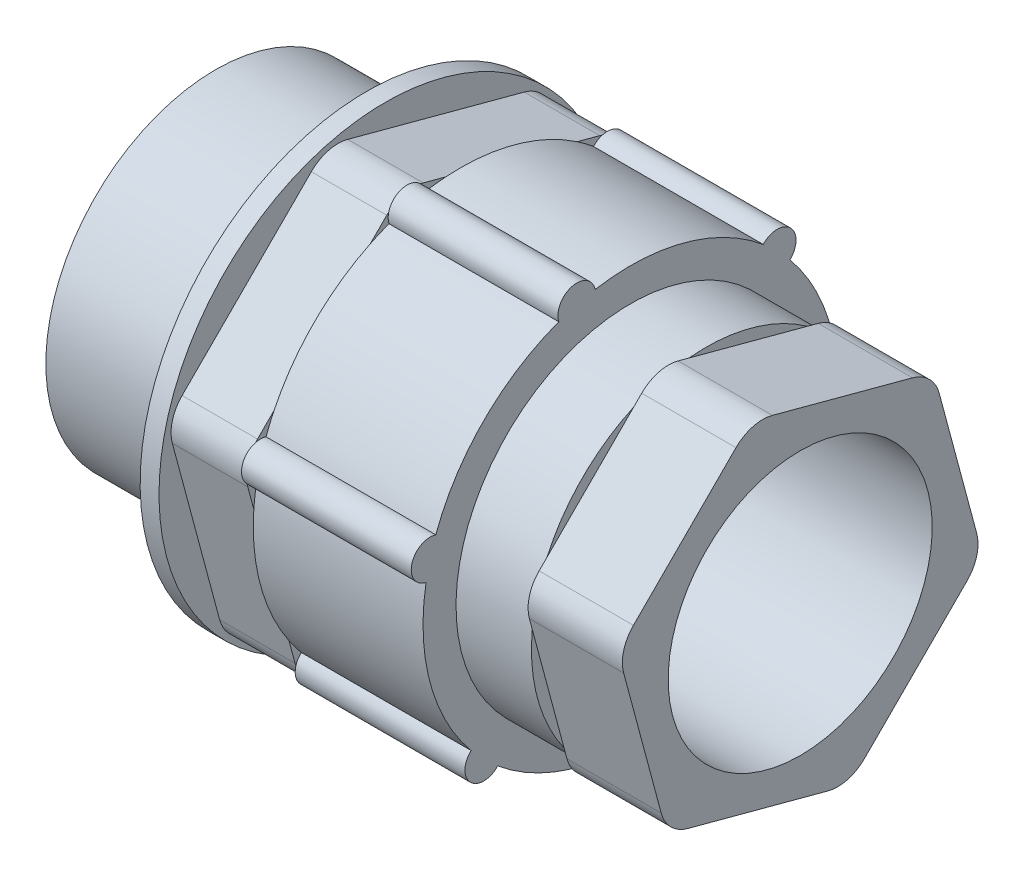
ISO-10303-21;
HEADER;
FILE_DESCRIPTION(('STEP AP214'),'2;1');
FILE_NAME('part.step','',(''),(''),'','','');
FILE_SCHEMA(('AUTOMOTIVE_DESIGN { 1 0 10303 214 1 1 1 1 }'));
ENDSEC;
DATA;
#1=APPLICATION_CONTEXT('core data for automotive mechanical design processes');
#2=APPLICATION_PROTOCOL_DEFINITION('international standard','automotive_design',2000,#1);
#3=PRODUCT_CONTEXT('',#1,'mechanical');
#4=PRODUCT('Part','Part','',(#3));
#5=PRODUCT_RELATED_PRODUCT_CATEGORY('part','',(#4));
#6=PRODUCT_DEFINITION_FORMATION('','',#4);
#7=PRODUCT_DEFINITION_CONTEXT('part definition',#1,'design');
#8=PRODUCT_DEFINITION('design','',#6,#7);
#9=PRODUCT_DEFINITION_SHAPE('','',#8);
#10=(LENGTH_UNIT() NAMED_UNIT(*) SI_UNIT(.MILLI.,.METRE.));
#11=(NAMED_UNIT(*) PLANE_ANGLE_UNIT() SI_UNIT($,.RADIAN.));
#12=(NAMED_UNIT(*) SI_UNIT($,.STERADIAN.) SOLID_ANGLE_UNIT());
#13=UNCERTAINTY_MEASURE_WITH_UNIT(LENGTH_MEASURE(1.E-05),#10,'distance_accuracy_value','');
#14=(GEOMETRIC_REPRESENTATION_CONTEXT(3) GLOBAL_UNCERTAINTY_ASSIGNED_CONTEXT((#13)) GLOBAL_UNIT_ASSIGNED_CONTEXT((#10,
#11,#12)) REPRESENTATION_CONTEXT('',''));
#15=CARTESIAN_POINT('',(0.,0.,0.));
#16=DIRECTION('',(0.,0.,1.));
#17=DIRECTION('',(1.,0.,0.));
#18=AXIS2_PLACEMENT_3D('',#15,#16,#17);
#19=CARTESIAN_POINT('',(40.5000000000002,87.889087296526,-54.3890872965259));
#20=DIRECTION('',(1.,0.,0.));
#21=DIRECTION('',(0.,1.,0.));
#22=AXIS2_PLACEMENT_3D('',#19,#20,#21);
#23=PLANE('',#22);
#24=DIRECTION('',(0.,-0.965925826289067,-0.258819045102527));
#25=VECTOR('',#24,1.);
#26=CARTESIAN_POINT('',(40.5000000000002,80.8941714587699,-62.0911099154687));
#27=LINE('',#26,#25);
#28=CARTESIAN_POINT('',(40.5000000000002,83.2070313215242,-61.4713809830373));
#29=VERTEX_POINT('',#28);
#30=CARTESIAN_POINT('',(40.5,90.1724215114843,-59.6050103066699));
#31=VERTEX_POINT('',#30);
#32=EDGE_CURVE('E766',#29,#31,#27,.F.);
#33=ORIENTED_EDGE('',*,*,#32,.T.);
#34=CARTESIAN_POINT('',(40.5000000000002,84.,-50.5));
#35=DIRECTION('',(-1.,0.,0.));
#36=DIRECTION('',(0.,-1.,0.));
#37=AXIS2_PLACEMENT_3D('',#34,#35,#36);
#38=CIRCLE('',#37,11.);
#39=EDGE_CURVE('E731',#29,#31,#38,.F.);
#40=ORIENTED_EDGE('',*,*,#39,.F.);
#41=EDGE_LOOP('',(#33,#40));
#42=FACE_BOUND('',#41,.T.);
#43=ADVANCED_FACE('F16',(#42),#23,.F.);
#44=CARTESIAN_POINT('',(40.5000000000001,104.076391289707,-55.8794528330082));
#45=DIRECTION('',(1.,0.,0.));
#46=DIRECTION('',(0.,1.,0.));
#47=AXIS2_PLACEMENT_3D('',#44,#45,#46);
#48=PLANE('',#47);
#49=CARTESIAN_POINT('',(40.5000000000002,91.778174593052,-58.278174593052));
#50=DIRECTION('',(-1.,0.,0.));
#51=DIRECTION('',(0.,-1.,0.));
#52=AXIS2_PLACEMENT_3D('',#49,#50,#51);
#53=CIRCLE('',#52,1.00000000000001);
#54=CARTESIAN_POINT('',(40.5000000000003,91.0396574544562,-58.9524092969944));
#55=VERTEX_POINT('',#54);
#56=CARTESIAN_POINT('',(40.5000000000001,91.5092079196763,-59.2413240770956));
#57=VERTEX_POINT('',#56);
#58=EDGE_CURVE('E723',#55,#57,#53,.F.);
#59=ORIENTED_EDGE('',*,*,#58,.F.);
#60=CARTESIAN_POINT('',(40.5000000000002,84.,-50.5));
#61=DIRECTION('',(-1.,0.,0.));
#62=DIRECTION('',(0.,-1.,0.));
#63=AXIS2_PLACEMENT_3D('',#60,#61,#62);
#64=CIRCLE('',#63,11.);
#65=EDGE_CURVE('E728',#31,#55,#64,.F.);
#66=ORIENTED_EDGE('',*,*,#65,.F.);
#67=DIRECTION('',(0.,-0.965925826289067,-0.258819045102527));
#68=VECTOR('',#67,1.);
#69=CARTESIAN_POINT('',(40.5000000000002,80.8941714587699,-62.0911099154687));
#70=LINE('',#69,#68);
#71=CARTESIAN_POINT('',(40.5000000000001,91.3699263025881,-59.2841398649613));
#72=VERTEX_POINT('',#71);
#73=EDGE_CURVE('E831',#31,#72,#70,.F.);
#74=ORIENTED_EDGE('',*,*,#73,.T.);
#75=CARTESIAN_POINT('',(40.5000000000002,90.8522882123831,-57.3522882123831));
#76=DIRECTION('',(-1.,0.,0.));
#77=DIRECTION('',(0.,-1.,0.));
#78=AXIS2_PLACEMENT_3D('',#75,#76,#77);
#79=CIRCLE('',#78,2.);
#80=EDGE_CURVE('E771',#57,#72,#79,.T.);
#81=ORIENTED_EDGE('',*,*,#80,.F.);
#82=EDGE_LOOP('',(#59,#66,#74,#81));
#83=FACE_BOUND('',#82,.T.);
#84=ADVANCED_FACE('F1833',(#83),#48,.T.);
#85=CARTESIAN_POINT('',(40.5000000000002,87.889087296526,-54.3890872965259));
#86=DIRECTION('',(1.,0.,0.));
#87=DIRECTION('',(0.,1.,0.));
#88=AXIS2_PLACEMENT_3D('',#85,#86,#87);
#89=PLANE('',#88);
#90=CARTESIAN_POINT('',(40.5000000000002,90.8522882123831,-57.3522882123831));
#91=DIRECTION('',(-1.,0.,0.));
#92=DIRECTION('',(0.,-1.,0.));
#93=AXIS2_PLACEMENT_3D('',#90,#91,#92);
#94=CIRCLE('',#93,2.);
#95=CARTESIAN_POINT('',(40.5000000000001,92.7413240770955,-58.0092079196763));
#96=VERTEX_POINT('',#95);
#97=EDGE_CURVE('E763',#96,#57,#94,.T.);
#98=ORIENTED_EDGE('',*,*,#97,.F.);
#99=CARTESIAN_POINT('',(40.5000000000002,91.778174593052,-58.278174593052));
#100=DIRECTION('',(-1.,0.,0.));
#101=DIRECTION('',(0.,-1.,0.));
#102=AXIS2_PLACEMENT_3D('',#99,#100,#101);
#103=CIRCLE('',#102,1.00000000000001);
#104=EDGE_CURVE('E719',#57,#96,#103,.F.);
#105=ORIENTED_EDGE('',*,*,#104,.F.);
#106=EDGE_LOOP('',(#98,#105));
#107=FACE_BOUND('',#106,.T.);
#108=ADVANCED_FACE('F1428',(#107),#89,.F.);
#109=CARTESIAN_POINT('',(40.5000000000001,104.076391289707,-55.8794528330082));
#110=DIRECTION('',(1.,0.,0.));
#111=DIRECTION('',(0.,1.,0.));
#112=AXIS2_PLACEMENT_3D('',#109,#110,#111);
#113=PLANE('',#112);
#114=DIRECTION('',(0.,-0.25881904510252,-0.965925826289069));
#115=VECTOR('',#114,1.);
#116=CARTESIAN_POINT('',(40.5,92.4852813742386,-58.9852813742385));
#117=LINE('',#116,#115);
#118=CARTESIAN_POINT('',(40.5000000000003,92.7841398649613,-57.8699263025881));
#119=VERTEX_POINT('',#118);
#120=CARTESIAN_POINT('',(40.5000000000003,93.1050103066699,-56.6724215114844));
#121=VERTEX_POINT('',#120);
#122=EDGE_CURVE('E774',#119,#121,#117,.F.);
#123=ORIENTED_EDGE('',*,*,#122,.T.);
#124=CARTESIAN_POINT('',(40.5000000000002,84.,-50.5));
#125=DIRECTION('',(-1.,0.,0.));
#126=DIRECTION('',(0.,-1.,0.));
#127=AXIS2_PLACEMENT_3D('',#124,#125,#126);
#128=CIRCLE('',#127,11.);
#129=CARTESIAN_POINT('',(40.5,92.4524092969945,-57.5396574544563));
#130=VERTEX_POINT('',#129);
#131=EDGE_CURVE('E712',#130,#121,#128,.F.);
#132=ORIENTED_EDGE('',*,*,#131,.F.);
#133=CARTESIAN_POINT('',(40.5000000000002,91.778174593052,-58.278174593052));
#134=DIRECTION('',(-1.,0.,0.));
#135=DIRECTION('',(0.,-1.,0.));
#136=AXIS2_PLACEMENT_3D('',#133,#134,#135);
#137=CIRCLE('',#136,1.00000000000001);
#138=EDGE_CURVE('E716',#96,#130,#137,.F.);
#139=ORIENTED_EDGE('',*,*,#138,.F.);
#140=CARTESIAN_POINT('',(40.5000000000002,90.8522882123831,-57.3522882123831));
#141=DIRECTION('',(-1.,0.,0.));
#142=DIRECTION('',(0.,-1.,0.));
#143=AXIS2_PLACEMENT_3D('',#140,#141,#142);
#144=CIRCLE('',#143,2.);
#145=EDGE_CURVE('E767',#119,#96,#144,.T.);
#146=ORIENTED_EDGE('',*,*,#145,.F.);
#147=EDGE_LOOP('',(#123,#132,#139,#146));
#148=FACE_BOUND('',#147,.T.);
#149=ADVANCED_FACE('F1418',(#148),#113,.T.);
#150=CARTESIAN_POINT('',(40.5000000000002,87.889087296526,-54.3890872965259));
#151=DIRECTION('',(1.,0.,0.));
#152=DIRECTION('',(0.,1.,0.));
#153=AXIS2_PLACEMENT_3D('',#150,#151,#152);
#154=PLANE('',#153);
#155=DIRECTION('',(0.,-0.25881904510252,-0.965925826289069));
#156=VECTOR('',#155,1.);
#157=CARTESIAN_POINT('',(40.5,92.4852813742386,-58.9852813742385));
#158=LINE('',#157,#156);
#159=CARTESIAN_POINT('',(40.5000000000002,94.9713809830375,-49.7070313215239));
#160=VERTEX_POINT('',#159);
#161=EDGE_CURVE('E778',#121,#160,#158,.F.);
#162=ORIENTED_EDGE('',*,*,#161,.T.);
#163=CARTESIAN_POINT('',(40.5000000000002,84.,-50.5));
#164=DIRECTION('',(-1.,0.,0.));
#165=DIRECTION('',(0.,-1.,0.));
#166=AXIS2_PLACEMENT_3D('',#163,#164,#165);
#167=CIRCLE('',#166,11.);
#168=EDGE_CURVE('E708',#121,#160,#167,.F.);
#169=ORIENTED_EDGE('',*,*,#168,.F.);
#170=EDGE_LOOP('',(#162,#169));
#171=FACE_BOUND('',#170,.T.);
#172=ADVANCED_FACE('F1421',(#171),#154,.F.);
#173=CARTESIAN_POINT('',(40.5000000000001,104.076391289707,-55.8794528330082));
#174=DIRECTION('',(1.,0.,0.));
#175=DIRECTION('',(0.,1.,0.));
#176=AXIS2_PLACEMENT_3D('',#173,#174,#175);
#177=PLANE('',#176);
#178=CARTESIAN_POINT('',(40.5000000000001,94.6251840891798,-47.6529905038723));
#179=DIRECTION('',(-1.,0.,0.));
#180=DIRECTION('',(0.,-1.,0.));
#181=AXIS2_PLACEMENT_3D('',#178,#179,#180);
#182=CIRCLE('',#181,1.00000000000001);
#183=CARTESIAN_POINT('',(40.5,94.8398299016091,-48.6296824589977));
#184=VERTEX_POINT('',#183);
#185=CARTESIAN_POINT('',(40.5000000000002,95.3248126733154,-48.3674972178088));
#186=VERTEX_POINT('',#185);
#187=EDGE_CURVE('E699',#184,#186,#182,.F.);
#188=ORIENTED_EDGE('',*,*,#187,.F.);
#189=CARTESIAN_POINT('',(40.5000000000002,84.,-50.5));
#190=DIRECTION('',(-1.,0.,0.));
#191=DIRECTION('',(0.,-1.,0.));
#192=AXIS2_PLACEMENT_3D('',#189,#190,#191);
#193=CIRCLE('',#192,11.);
#194=EDGE_CURVE('E704',#160,#184,#193,.F.);
#195=ORIENTED_EDGE('',*,*,#194,.F.);
#196=DIRECTION('',(0.,-0.25881904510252,-0.965925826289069));
#197=VECTOR('',#196,1.);
#198=CARTESIAN_POINT('',(40.5,92.4852813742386,-58.9852813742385));
#199=LINE('',#198,#197);
#200=CARTESIAN_POINT('',(40.5,95.2922514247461,-48.5095265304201));
#201=VERTEX_POINT('',#200);
#202=EDGE_CURVE('E825',#160,#201,#199,.F.);
#203=ORIENTED_EDGE('',*,*,#202,.T.);
#204=CARTESIAN_POINT('',(40.5000000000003,93.3603997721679,-47.9918884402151));
#205=DIRECTION('',(-1.,0.,0.));
#206=DIRECTION('',(0.,-1.,0.));
#207=AXIS2_PLACEMENT_3D('',#204,#205,#206);
#208=CIRCLE('',#207,2.);
#209=EDGE_CURVE('E783',#186,#201,#208,.T.);
#210=ORIENTED_EDGE('',*,*,#209,.F.);
#211=EDGE_LOOP('',(#188,#195,#203,#210));
#212=FACE_BOUND('',#211,.T.);
#213=ADVANCED_FACE('F1377',(#212),#177,.T.);
#214=CARTESIAN_POINT('',(40.5000000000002,87.889087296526,-54.3890872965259));
#215=DIRECTION('',(1.,0.,0.));
#216=DIRECTION('',(0.,1.,0.));
#217=AXIS2_PLACEMENT_3D('',#214,#215,#216);
#218=PLANE('',#217);
#219=CARTESIAN_POINT('',(40.5000000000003,93.3603997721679,-47.9918884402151));
#220=DIRECTION('',(-1.,0.,0.));
#221=DIRECTION('',(0.,-1.,0.));
#222=AXIS2_PLACEMENT_3D('',#219,#220,#221);
#223=CIRCLE('',#222,2.);
#224=CARTESIAN_POINT('',(40.5000000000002,94.8738268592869,-46.684395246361));
#225=VERTEX_POINT('',#224);
#226=EDGE_CURVE('E775',#225,#186,#223,.T.);
#227=ORIENTED_EDGE('',*,*,#226,.F.);
#228=CARTESIAN_POINT('',(40.5000000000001,94.6251840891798,-47.6529905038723));
#229=DIRECTION('',(-1.,0.,0.));
#230=DIRECTION('',(0.,-1.,0.));
#231=AXIS2_PLACEMENT_3D('',#228,#229,#230);
#232=CIRCLE('',#231,1.00000000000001);
#233=EDGE_CURVE('E695',#186,#225,#232,.F.);
#234=ORIENTED_EDGE('',*,*,#233,.F.);
#235=EDGE_LOOP('',(#227,#234));
#236=FACE_BOUND('',#235,.T.);
#237=ADVANCED_FACE('F1094',(#236),#218,.F.);
#238=CARTESIAN_POINT('',(40.5000000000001,104.076391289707,-55.8794528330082));
#239=DIRECTION('',(1.,0.,0.));
#240=DIRECTION('',(0.,1.,0.));
#241=AXIS2_PLACEMENT_3D('',#238,#239,#240);
#242=PLANE('',#241);
#243=DIRECTION('',(0.,0.70710678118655,-0.707106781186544));
#244=VECTOR('',#243,1.);
#245=CARTESIAN_POINT('',(40.5000000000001,95.5911099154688,-47.3941714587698));
#246=LINE('',#245,#244);
#247=CARTESIAN_POINT('',(40.5000000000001,94.7746133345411,-46.5776748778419));
#248=VERTEX_POINT('',#247);
#249=CARTESIAN_POINT('',(40.5000000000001,93.8979789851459,-45.701040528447));
#250=VERTEX_POINT('',#249);
#251=EDGE_CURVE('E786',#248,#250,#246,.F.);
#252=ORIENTED_EDGE('',*,*,#251,.T.);
#253=CARTESIAN_POINT('',(40.5000000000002,84.,-50.5));
#254=DIRECTION('',(-1.,0.,0.));
#255=DIRECTION('',(0.,-1.,0.));
#256=AXIS2_PLACEMENT_3D('',#253,#254,#255);
#257=CIRCLE('',#256,11.);
#258=CARTESIAN_POINT('',(40.5000000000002,94.3227268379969,-46.6998275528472));
#259=VERTEX_POINT('',#258);
#260=EDGE_CURVE('E687',#259,#250,#257,.F.);
#261=ORIENTED_EDGE('',*,*,#260,.F.);
#262=CARTESIAN_POINT('',(40.5000000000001,94.6251840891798,-47.6529905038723));
#263=DIRECTION('',(-1.,0.,0.));
#264=DIRECTION('',(0.,-1.,0.));
#265=AXIS2_PLACEMENT_3D('',#262,#263,#264);
#266=CIRCLE('',#265,1.00000000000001);
#267=EDGE_CURVE('E692',#225,#259,#266,.F.);
#268=ORIENTED_EDGE('',*,*,#267,.F.);
#269=CARTESIAN_POINT('',(40.5000000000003,93.3603997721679,-47.9918884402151));
#270=DIRECTION('',(-1.,0.,0.));
#271=DIRECTION('',(0.,-1.,0.));
#272=AXIS2_PLACEMENT_3D('',#269,#270,#271);
#273=CIRCLE('',#272,2.);
#274=EDGE_CURVE('E779',#248,#225,#273,.T.);
#275=ORIENTED_EDGE('',*,*,#274,.F.);
#276=EDGE_LOOP('',(#252,#261,#268,#275));
#277=FACE_BOUND('',#276,.T.);
#278=ADVANCED_FACE('F1061',(#277),#242,.T.);
#279=CARTESIAN_POINT('',(40.5000000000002,87.889087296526,-54.3890872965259));
#280=DIRECTION('',(1.,0.,0.));
#281=DIRECTION('',(0.,1.,0.));
#282=AXIS2_PLACEMENT_3D('',#279,#280,#281);
#283=PLANE('',#282);
#284=DIRECTION('',(0.,0.70710678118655,-0.707106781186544));
#285=VECTOR('',#284,1.);
#286=CARTESIAN_POINT('',(40.5000000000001,95.5911099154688,-47.3941714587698));
#287=LINE('',#286,#285);
#288=CARTESIAN_POINT('',(40.5,88.798959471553,-40.602021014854));
#289=VERTEX_POINT('',#288);
#290=EDGE_CURVE('E790',#250,#289,#287,.F.);
#291=ORIENTED_EDGE('',*,*,#290,.T.);
#292=CARTESIAN_POINT('',(40.5000000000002,84.,-50.5));
#293=DIRECTION('',(-1.,0.,0.));
#294=DIRECTION('',(0.,-1.,0.));
#295=AXIS2_PLACEMENT_3D('',#292,#293,#294);
#296=CIRCLE('',#295,11.);
#297=EDGE_CURVE('E683',#250,#289,#296,.F.);
#298=ORIENTED_EDGE('',*,*,#297,.F.);
#299=EDGE_LOOP('',(#291,#298));
#300=FACE_BOUND('',#299,.T.);
#301=ADVANCED_FACE('F1085',(#300),#283,.F.);
#302=CARTESIAN_POINT('',(40.5000000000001,104.076391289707,-55.8794528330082));
#303=DIRECTION('',(1.,0.,0.));
#304=DIRECTION('',(0.,1.,0.));
#305=AXIS2_PLACEMENT_3D('',#302,#303,#304);
#306=PLANE('',#305);
#307=CARTESIAN_POINT('',(40.5000000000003,86.8470094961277,-39.8748159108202));
#308=DIRECTION('',(-1.,0.,0.));
#309=DIRECTION('',(0.,-1.,0.));
#310=AXIS2_PLACEMENT_3D('',#307,#308,#309);
#311=CIRCLE('',#310,1.00000000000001);
#312=CARTESIAN_POINT('',(40.5000000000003,87.8001724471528,-40.1772731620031));
#313=VERTEX_POINT('',#312);
#314=CARTESIAN_POINT('',(40.5000000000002,87.8156047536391,-39.6261731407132));
#315=VERTEX_POINT('',#314);
#316=EDGE_CURVE('E675',#313,#315,#311,.F.);
#317=ORIENTED_EDGE('',*,*,#316,.F.);
#318=CARTESIAN_POINT('',(40.5000000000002,84.,-50.5));
#319=DIRECTION('',(-1.,0.,0.));
#320=DIRECTION('',(0.,-1.,0.));
#321=AXIS2_PLACEMENT_3D('',#318,#319,#320);
#322=CIRCLE('',#321,11.);
#323=EDGE_CURVE('E680',#289,#313,#322,.F.);
#324=ORIENTED_EDGE('',*,*,#323,.F.);
#325=DIRECTION('',(0.,0.70710678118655,-0.707106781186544));
#326=VECTOR('',#325,1.);
#327=CARTESIAN_POINT('',(40.5000000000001,95.5911099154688,-47.3941714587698));
#328=LINE('',#327,#326);
#329=CARTESIAN_POINT('',(40.5,87.9223251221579,-39.7253866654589));
#330=VERTEX_POINT('',#329);
#331=EDGE_CURVE('E838',#289,#330,#328,.F.);
#332=ORIENTED_EDGE('',*,*,#331,.T.);
#333=CARTESIAN_POINT('',(40.5,86.5081115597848,-41.139600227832));
#334=DIRECTION('',(-1.,0.,0.));
#335=DIRECTION('',(0.,-1.,0.));
#336=AXIS2_PLACEMENT_3D('',#333,#334,#335);
#337=CIRCLE('',#336,2.);
#338=EDGE_CURVE('E795',#315,#330,#337,.T.);
#339=ORIENTED_EDGE('',*,*,#338,.F.);
#340=EDGE_LOOP('',(#317,#324,#332,#339));
#341=FACE_BOUND('',#340,.T.);
#342=ADVANCED_FACE('F1083',(#341),#306,.T.);
#343=CARTESIAN_POINT('',(40.5000000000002,87.889087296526,-54.3890872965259));
#344=DIRECTION('',(1.,0.,0.));
#345=DIRECTION('',(0.,1.,0.));
#346=AXIS2_PLACEMENT_3D('',#343,#344,#345);
#347=PLANE('',#346);
#348=CARTESIAN_POINT('',(40.5,86.5081115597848,-41.139600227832));
#349=DIRECTION('',(-1.,0.,0.));
#350=DIRECTION('',(0.,-1.,0.));
#351=AXIS2_PLACEMENT_3D('',#348,#349,#350);
#352=CIRCLE('',#351,2.);
#353=CARTESIAN_POINT('',(40.4999999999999,86.1325027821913,-39.1751873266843));
#354=VERTEX_POINT('',#353);
#355=EDGE_CURVE('E787',#354,#315,#352,.T.);
#356=ORIENTED_EDGE('',*,*,#355,.F.);
#357=CARTESIAN_POINT('',(40.5000000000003,86.8470094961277,-39.8748159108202));
#358=DIRECTION('',(-1.,0.,0.));
#359=DIRECTION('',(0.,-1.,0.));
#360=AXIS2_PLACEMENT_3D('',#357,#358,#359);
#361=CIRCLE('',#360,1.00000000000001);
#362=EDGE_CURVE('E671',#315,#354,#361,.F.);
#363=ORIENTED_EDGE('',*,*,#362,.F.);
#364=EDGE_LOOP('',(#356,#363));
#365=FACE_BOUND('',#364,.T.);
#366=ADVANCED_FACE('F1092',(#365),#347,.F.);
#367=CARTESIAN_POINT('',(40.5000000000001,104.076391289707,-55.8794528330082));
#368=DIRECTION('',(1.,0.,0.));
#369=DIRECTION('',(0.,1.,0.));
#370=AXIS2_PLACEMENT_3D('',#367,#368,#369);
#371=PLANE('',#370);
#372=DIRECTION('',(0.,0.965925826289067,0.258819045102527));
#373=VECTOR('',#372,1.);
#374=CARTESIAN_POINT('',(40.5,87.1058285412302,-38.9088900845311));
#375=LINE('',#374,#373);
#376=CARTESIAN_POINT('',(40.5,85.9904734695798,-39.2077485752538));
#377=VERTEX_POINT('',#376);
#378=CARTESIAN_POINT('',(40.5000000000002,84.7929686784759,-39.5286190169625));
#379=VERTEX_POINT('',#378);
#380=EDGE_CURVE('E797',#377,#379,#375,.F.);
#381=ORIENTED_EDGE('',*,*,#380,.T.);
#382=CARTESIAN_POINT('',(40.5000000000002,84.,-50.5));
#383=DIRECTION('',(-1.,0.,0.));
#384=DIRECTION('',(0.,-1.,0.));
#385=AXIS2_PLACEMENT_3D('',#382,#383,#384);
#386=CIRCLE('',#385,11.);
#387=CARTESIAN_POINT('',(40.4999999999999,85.8703175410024,-39.6601700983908));
#388=VERTEX_POINT('',#387);
#389=EDGE_CURVE('E664',#388,#379,#386,.F.);
#390=ORIENTED_EDGE('',*,*,#389,.F.);
#391=CARTESIAN_POINT('',(40.5000000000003,86.8470094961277,-39.8748159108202));
#392=DIRECTION('',(-1.,0.,0.));
#393=DIRECTION('',(0.,-1.,0.));
#394=AXIS2_PLACEMENT_3D('',#391,#392,#393);
#395=CIRCLE('',#394,1.00000000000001);
#396=EDGE_CURVE('E668',#354,#388,#395,.F.);
#397=ORIENTED_EDGE('',*,*,#396,.F.);
#398=CARTESIAN_POINT('',(40.5,86.5081115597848,-41.139600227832));
#399=DIRECTION('',(-1.,0.,0.));
#400=DIRECTION('',(0.,-1.,0.));
#401=AXIS2_PLACEMENT_3D('',#398,#399,#400);
#402=CIRCLE('',#401,2.);
#403=EDGE_CURVE('E791',#377,#354,#402,.T.);
#404=ORIENTED_EDGE('',*,*,#403,.F.);
#405=EDGE_LOOP('',(#381,#390,#397,#404));
#406=FACE_BOUND('',#405,.T.);
#407=ADVANCED_FACE('F1355',(#406),#371,.T.);
#408=CARTESIAN_POINT('',(40.5000000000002,87.889087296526,-54.3890872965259));
#409=DIRECTION('',(1.,0.,0.));
#410=DIRECTION('',(0.,1.,0.));
#411=AXIS2_PLACEMENT_3D('',#408,#409,#410);
#412=PLANE('',#411);
#413=DIRECTION('',(0.,0.965925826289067,0.258819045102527));
#414=VECTOR('',#413,1.);
#415=CARTESIAN_POINT('',(40.5,87.1058285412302,-38.9088900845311));
#416=LINE('',#415,#414);
#417=CARTESIAN_POINT('',(40.5000000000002,77.8275784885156,-41.3949896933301));
#418=VERTEX_POINT('',#417);
#419=EDGE_CURVE('E368',#379,#418,#416,.F.);
#420=ORIENTED_EDGE('',*,*,#419,.T.);
#421=CARTESIAN_POINT('',(40.5000000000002,84.,-50.5));
#422=DIRECTION('',(-1.,0.,0.));
#423=DIRECTION('',(0.,-1.,0.));
#424=AXIS2_PLACEMENT_3D('',#421,#422,#423);
#425=CIRCLE('',#424,11.);
#426=EDGE_CURVE('E660',#379,#418,#425,.F.);
#427=ORIENTED_EDGE('',*,*,#426,.F.);
#428=EDGE_LOOP('',(#420,#427));
#429=FACE_BOUND('',#428,.T.);
#430=ADVANCED_FACE('F1352',(#429),#412,.F.);
#431=CARTESIAN_POINT('',(40.5000000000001,104.076391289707,-55.8794528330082));
#432=DIRECTION('',(1.,0.,0.));
#433=DIRECTION('',(0.,1.,0.));
#434=AXIS2_PLACEMENT_3D('',#431,#432,#433);
#435=PLANE('',#434);
#436=CARTESIAN_POINT('',(40.4999999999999,76.221825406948,-42.7218254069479));
#437=DIRECTION('',(-1.,0.,0.));
#438=DIRECTION('',(0.,-1.,0.));
#439=AXIS2_PLACEMENT_3D('',#436,#437,#438);
#440=CIRCLE('',#439,1.00000000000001);
#441=CARTESIAN_POINT('',(40.5000000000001,76.9603425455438,-42.0475907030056));
#442=VERTEX_POINT('',#441);
#443=CARTESIAN_POINT('',(40.4999999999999,76.4907920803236,-41.7586759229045));
#444=VERTEX_POINT('',#443);
#445=EDGE_CURVE('E377',#442,#444,#440,.F.);
#446=ORIENTED_EDGE('',*,*,#445,.F.);
#447=CARTESIAN_POINT('',(40.5000000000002,84.,-50.5));
#448=DIRECTION('',(-1.,0.,0.));
#449=DIRECTION('',(0.,-1.,0.));
#450=AXIS2_PLACEMENT_3D('',#447,#448,#449);
#451=CIRCLE('',#450,11.);
#452=EDGE_CURVE('E656',#418,#442,#451,.F.);
#453=ORIENTED_EDGE('',*,*,#452,.F.);
#454=DIRECTION('',(0.,0.965925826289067,0.258819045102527));
#455=VECTOR('',#454,1.);
#456=CARTESIAN_POINT('',(40.5,87.1058285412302,-38.9088900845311));
#457=LINE('',#456,#455);
#458=CARTESIAN_POINT('',(40.5000000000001,76.6300736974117,-41.7158601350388));
#459=VERTEX_POINT('',#458);
#460=EDGE_CURVE('E391',#418,#459,#457,.F.);
#461=ORIENTED_EDGE('',*,*,#460,.T.);
#462=CARTESIAN_POINT('',(40.5000000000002,77.1477117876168,-43.6477117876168));
#463=DIRECTION('',(-1.,0.,0.));
#464=DIRECTION('',(0.,-1.,0.));
#465=AXIS2_PLACEMENT_3D('',#462,#463,#464);
#466=CIRCLE('',#465,2.);
#467=EDGE_CURVE('E20',#444,#459,#466,.T.);
#468=ORIENTED_EDGE('',*,*,#467,.F.);
#469=EDGE_LOOP('',(#446,#453,#461,#468));
#470=FACE_BOUND('',#469,.T.);
#471=ADVANCED_FACE('F390',(#470),#435,.T.);
#472=CARTESIAN_POINT('',(40.5000000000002,87.889087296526,-54.3890872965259));
#473=DIRECTION('',(1.,0.,0.));
#474=DIRECTION('',(0.,1.,0.));
#475=AXIS2_PLACEMENT_3D('',#472,#473,#474);
#476=PLANE('',#475);
#477=CARTESIAN_POINT('',(40.5000000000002,77.1477117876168,-43.6477117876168));
#478=DIRECTION('',(-1.,0.,0.));
#479=DIRECTION('',(0.,-1.,0.));
#480=AXIS2_PLACEMENT_3D('',#477,#478,#479);
#481=CIRCLE('',#480,2.);
#482=CARTESIAN_POINT('',(40.5000000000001,75.2586759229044,-42.9907920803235));
#483=VERTEX_POINT('',#482);
#484=EDGE_CURVE('E356',#483,#444,#481,.T.);
#485=ORIENTED_EDGE('',*,*,#484,.F.);
#486=CARTESIAN_POINT('',(40.4999999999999,76.221825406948,-42.7218254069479));
#487=DIRECTION('',(-1.,0.,0.));
#488=DIRECTION('',(0.,-1.,0.));
#489=AXIS2_PLACEMENT_3D('',#486,#487,#488);
#490=CIRCLE('',#489,1.00000000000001);
#491=EDGE_CURVE('E371',#444,#483,#490,.F.);
#492=ORIENTED_EDGE('',*,*,#491,.F.);
#493=EDGE_LOOP('',(#485,#492));
#494=FACE_BOUND('',#493,.T.);
#495=ADVANCED_FACE('F373',(#494),#476,.F.);
#496=CARTESIAN_POINT('',(40.5000000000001,104.076391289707,-55.8794528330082));
#497=DIRECTION('',(1.,0.,0.));
#498=DIRECTION('',(0.,1.,0.));
#499=AXIS2_PLACEMENT_3D('',#496,#497,#498);
#500=PLANE('',#499);
#501=DIRECTION('',(0.,0.258819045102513,0.965925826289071));
#502=VECTOR('',#501,1.);
#503=CARTESIAN_POINT('',(40.5000000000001,75.5147186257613,-42.0147186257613));
#504=LINE('',#503,#502);
#505=CARTESIAN_POINT('',(40.5000000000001,75.2158601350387,-43.1300736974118));
#506=VERTEX_POINT('',#505);
#507=CARTESIAN_POINT('',(40.5,74.89498969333,-44.3275784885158));
#508=VERTEX_POINT('',#507);
#509=EDGE_CURVE('E394',#506,#508,#504,.F.);
#510=ORIENTED_EDGE('',*,*,#509,.T.);
#511=CARTESIAN_POINT('',(40.5000000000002,84.,-50.5));
#512=DIRECTION('',(-1.,0.,0.));
#513=DIRECTION('',(0.,-1.,0.));
#514=AXIS2_PLACEMENT_3D('',#511,#512,#513);
#515=CIRCLE('',#514,11.);
#516=CARTESIAN_POINT('',(40.5000000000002,75.5475907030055,-43.4603425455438));
#517=VERTEX_POINT('',#516);
#518=EDGE_CURVE('E650',#517,#508,#515,.F.);
#519=ORIENTED_EDGE('',*,*,#518,.F.);
#520=CARTESIAN_POINT('',(40.4999999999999,76.221825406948,-42.7218254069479));
#521=DIRECTION('',(-1.,0.,0.));
#522=DIRECTION('',(0.,-1.,0.));
#523=AXIS2_PLACEMENT_3D('',#520,#521,#522);
#524=CIRCLE('',#523,1.00000000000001);
#525=EDGE_CURVE('E376',#483,#517,#524,.F.);
#526=ORIENTED_EDGE('',*,*,#525,.F.);
#527=CARTESIAN_POINT('',(40.5000000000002,77.1477117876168,-43.6477117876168));
#528=DIRECTION('',(-1.,0.,0.));
#529=DIRECTION('',(0.,-1.,0.));
#530=AXIS2_PLACEMENT_3D('',#527,#528,#529);
#531=CIRCLE('',#530,2.);
#532=EDGE_CURVE('E364',#506,#483,#531,.T.);
#533=ORIENTED_EDGE('',*,*,#532,.F.);
#534=EDGE_LOOP('',(#510,#519,#526,#533));
#535=FACE_BOUND('',#534,.T.);
#536=ADVANCED_FACE('F1344',(#535),#500,.T.);
#537=CARTESIAN_POINT('',(40.5000000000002,87.889087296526,-54.3890872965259));
#538=DIRECTION('',(1.,0.,0.));
#539=DIRECTION('',(0.,1.,0.));
#540=AXIS2_PLACEMENT_3D('',#537,#538,#539);
#541=PLANE('',#540);
#542=DIRECTION('',(0.,0.258819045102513,0.965925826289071));
#543=VECTOR('',#542,1.);
#544=CARTESIAN_POINT('',(40.5000000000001,75.5147186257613,-42.0147186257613));
#545=LINE('',#544,#543);
#546=CARTESIAN_POINT('',(40.4999999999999,73.0286190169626,-51.2929686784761));
#547=VERTEX_POINT('',#546);
#548=EDGE_CURVE('E409',#508,#547,#545,.F.);
#549=ORIENTED_EDGE('',*,*,#548,.T.);
#550=CARTESIAN_POINT('',(40.5000000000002,84.,-50.5));
#551=DIRECTION('',(-1.,0.,0.));
#552=DIRECTION('',(0.,-1.,0.));
#553=AXIS2_PLACEMENT_3D('',#550,#551,#552);
#554=CIRCLE('',#553,11.);
#555=EDGE_CURVE('E646',#508,#547,#554,.F.);
#556=ORIENTED_EDGE('',*,*,#555,.F.);
#557=EDGE_LOOP('',(#549,#556));
#558=FACE_BOUND('',#557,.T.);
#559=ADVANCED_FACE('F1340',(#558),#541,.F.);
#560=CARTESIAN_POINT('',(40.5000000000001,104.076391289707,-55.8794528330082));
#561=DIRECTION('',(1.,0.,0.));
#562=DIRECTION('',(0.,1.,0.));
#563=AXIS2_PLACEMENT_3D('',#560,#561,#562);
#564=PLANE('',#563);
#565=CARTESIAN_POINT('',(40.5000000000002,73.3748159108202,-53.3470094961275));
#566=DIRECTION('',(-1.,0.,0.));
#567=DIRECTION('',(0.,-1.,0.));
#568=AXIS2_PLACEMENT_3D('',#565,#566,#567);
#569=CIRCLE('',#568,1.00000000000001);
#570=CARTESIAN_POINT('',(40.5000000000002,73.1601700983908,-52.3703175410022));
#571=VERTEX_POINT('',#570);
#572=CARTESIAN_POINT('',(40.5000000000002,72.6751873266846,-52.6325027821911));
#573=VERTEX_POINT('',#572);
#574=EDGE_CURVE('E639',#571,#573,#569,.F.);
#575=ORIENTED_EDGE('',*,*,#574,.F.);
#576=CARTESIAN_POINT('',(40.5000000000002,84.,-50.5));
#577=DIRECTION('',(-1.,0.,0.));
#578=DIRECTION('',(0.,-1.,0.));
#579=AXIS2_PLACEMENT_3D('',#576,#577,#578);
#580=CIRCLE('',#579,11.);
#581=EDGE_CURVE('E643',#547,#571,#580,.F.);
#582=ORIENTED_EDGE('',*,*,#581,.F.);
#583=DIRECTION('',(0.,0.258819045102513,0.965925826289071));
#584=VECTOR('',#583,1.);
#585=CARTESIAN_POINT('',(40.5000000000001,75.5147186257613,-42.0147186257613));
#586=LINE('',#585,#584);
#587=CARTESIAN_POINT('',(40.5000000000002,72.7077485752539,-52.4904734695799));
#588=VERTEX_POINT('',#587);
#589=EDGE_CURVE('E402',#547,#588,#586,.F.);
#590=ORIENTED_EDGE('',*,*,#589,.T.);
#591=CARTESIAN_POINT('',(40.5000000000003,74.639600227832,-53.0081115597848));
#592=DIRECTION('',(-1.,0.,0.));
#593=DIRECTION('',(0.,-1.,0.));
#594=AXIS2_PLACEMENT_3D('',#591,#592,#593);
#595=CIRCLE('',#594,2.);
#596=EDGE_CURVE('E746',#573,#588,#595,.T.);
#597=ORIENTED_EDGE('',*,*,#596,.F.);
#598=EDGE_LOOP('',(#575,#582,#590,#597));
#599=FACE_BOUND('',#598,.T.);
#600=ADVANCED_FACE('F1336',(#599),#564,.T.);
#601=CARTESIAN_POINT('',(40.5000000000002,87.889087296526,-54.3890872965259));
#602=DIRECTION('',(1.,0.,0.));
#603=DIRECTION('',(0.,1.,0.));
#604=AXIS2_PLACEMENT_3D('',#601,#602,#603);
#605=PLANE('',#604);
#606=CARTESIAN_POINT('',(40.5000000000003,74.639600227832,-53.0081115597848));
#607=DIRECTION('',(-1.,0.,0.));
#608=DIRECTION('',(0.,-1.,0.));
#609=AXIS2_PLACEMENT_3D('',#606,#607,#608);
#610=CIRCLE('',#609,2.);
#611=CARTESIAN_POINT('',(40.5,73.126173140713,-54.3156047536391));
#612=VERTEX_POINT('',#611);
#613=EDGE_CURVE('E739',#612,#573,#610,.T.);
#614=ORIENTED_EDGE('',*,*,#613,.F.);
#615=CARTESIAN_POINT('',(40.5000000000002,73.3748159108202,-53.3470094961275));
#616=DIRECTION('',(-1.,0.,0.));
#617=DIRECTION('',(0.,-1.,0.));
#618=AXIS2_PLACEMENT_3D('',#615,#616,#617);
#619=CIRCLE('',#618,1.00000000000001);
#620=EDGE_CURVE('E635',#573,#612,#619,.F.);
#621=ORIENTED_EDGE('',*,*,#620,.F.);
#622=EDGE_LOOP('',(#614,#621));
#623=FACE_BOUND('',#622,.T.);
#624=ADVANCED_FACE('F1332',(#623),#605,.F.);
#625=CARTESIAN_POINT('',(40.5000000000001,104.076391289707,-55.8794528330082));
#626=DIRECTION('',(1.,0.,0.));
#627=DIRECTION('',(0.,1.,0.));
#628=AXIS2_PLACEMENT_3D('',#625,#626,#627);
#629=PLANE('',#628);
#630=DIRECTION('',(0.,-0.707106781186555,0.70710678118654));
#631=VECTOR('',#630,1.);
#632=CARTESIAN_POINT('',(40.5,72.4088900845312,-53.6058285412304));
#633=LINE('',#632,#631);
#634=CARTESIAN_POINT('',(40.5000000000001,73.2253866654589,-54.4223251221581));
#635=VERTEX_POINT('',#634);
#636=CARTESIAN_POINT('',(40.4999999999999,74.1020210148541,-55.2989594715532));
#637=VERTEX_POINT('',#636);
#638=EDGE_CURVE('E754',#635,#637,#633,.F.);
#639=ORIENTED_EDGE('',*,*,#638,.T.);
#640=CARTESIAN_POINT('',(40.5000000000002,84.,-50.5));
#641=DIRECTION('',(-1.,0.,0.));
#642=DIRECTION('',(0.,-1.,0.));
#643=AXIS2_PLACEMENT_3D('',#640,#641,#642);
#644=CIRCLE('',#643,11.);
#645=CARTESIAN_POINT('',(40.5000000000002,73.6772731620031,-54.3001724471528));
#646=VERTEX_POINT('',#645);
#647=EDGE_CURVE('E627',#646,#637,#644,.F.);
#648=ORIENTED_EDGE('',*,*,#647,.F.);
#649=CARTESIAN_POINT('',(40.5000000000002,73.3748159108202,-53.3470094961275));
#650=DIRECTION('',(-1.,0.,0.));
#651=DIRECTION('',(0.,-1.,0.));
#652=AXIS2_PLACEMENT_3D('',#649,#650,#651);
#653=CIRCLE('',#652,1.00000000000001);
#654=EDGE_CURVE('E632',#612,#646,#653,.F.);
#655=ORIENTED_EDGE('',*,*,#654,.F.);
#656=CARTESIAN_POINT('',(40.5000000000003,74.639600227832,-53.0081115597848));
#657=DIRECTION('',(-1.,0.,0.));
#658=DIRECTION('',(0.,-1.,0.));
#659=AXIS2_PLACEMENT_3D('',#656,#657,#658);
#660=CIRCLE('',#659,2.);
#661=EDGE_CURVE('E742',#635,#612,#660,.T.);
#662=ORIENTED_EDGE('',*,*,#661,.F.);
#663=EDGE_LOOP('',(#639,#648,#655,#662));
#664=FACE_BOUND('',#663,.T.);
#665=ADVANCED_FACE('F1328',(#664),#629,.T.);
#666=CARTESIAN_POINT('',(40.5000000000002,87.889087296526,-54.3890872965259));
#667=DIRECTION('',(1.,0.,0.));
#668=DIRECTION('',(0.,1.,0.));
#669=AXIS2_PLACEMENT_3D('',#666,#667,#668);
#670=PLANE('',#669);
#671=DIRECTION('',(0.,-0.707106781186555,0.70710678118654));
#672=VECTOR('',#671,1.);
#673=CARTESIAN_POINT('',(40.5,72.4088900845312,-53.6058285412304));
#674=LINE('',#673,#672);
#675=CARTESIAN_POINT('',(40.5000000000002,79.2010405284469,-60.3979789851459));
#676=VERTEX_POINT('',#675);
#677=EDGE_CURVE('E802',#637,#676,#674,.F.);
#678=ORIENTED_EDGE('',*,*,#677,.T.);
#679=CARTESIAN_POINT('',(40.5000000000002,84.,-50.5));
#680=DIRECTION('',(-1.,0.,0.));
#681=DIRECTION('',(0.,-1.,0.));
#682=AXIS2_PLACEMENT_3D('',#679,#680,#681);
#683=CIRCLE('',#682,11.);
#684=EDGE_CURVE('E623',#637,#676,#683,.F.);
#685=ORIENTED_EDGE('',*,*,#684,.F.);
#686=EDGE_LOOP('',(#678,#685));
#687=FACE_BOUND('',#686,.T.);
#688=ADVANCED_FACE('F1324',(#687),#670,.F.);
#689=CARTESIAN_POINT('',(40.5000000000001,104.076391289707,-55.8794528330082));
#690=DIRECTION('',(1.,0.,0.));
#691=DIRECTION('',(0.,1.,0.));
#692=AXIS2_PLACEMENT_3D('',#689,#690,#691);
#693=PLANE('',#692);
#694=CARTESIAN_POINT('',(40.5000000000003,81.1529905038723,-61.1251840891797));
#695=DIRECTION('',(-1.,0.,0.));
#696=DIRECTION('',(0.,-1.,0.));
#697=AXIS2_PLACEMENT_3D('',#694,#695,#696);
#698=CIRCLE('',#697,1.00000000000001);
#699=CARTESIAN_POINT('',(40.5000000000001,80.1998275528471,-60.8227268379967));
#700=VERTEX_POINT('',#699);
#701=CARTESIAN_POINT('',(40.5,80.1843952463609,-61.3738268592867));
#702=VERTEX_POINT('',#701);
#703=EDGE_CURVE('E616',#700,#702,#698,.F.);
#704=ORIENTED_EDGE('',*,*,#703,.F.);
#705=CARTESIAN_POINT('',(40.5000000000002,84.,-50.5));
#706=DIRECTION('',(-1.,0.,0.));
#707=DIRECTION('',(0.,-1.,0.));
#708=AXIS2_PLACEMENT_3D('',#705,#706,#707);
#709=CIRCLE('',#708,11.);
#710=EDGE_CURVE('E620',#676,#700,#709,.F.);
#711=ORIENTED_EDGE('',*,*,#710,.F.);
#712=DIRECTION('',(0.,-0.707106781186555,0.70710678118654));
#713=VECTOR('',#712,1.);
#714=CARTESIAN_POINT('',(40.5,72.4088900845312,-53.6058285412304));
#715=LINE('',#714,#713);
#716=CARTESIAN_POINT('',(40.5,80.0776748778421,-61.2746133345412));
#717=VERTEX_POINT('',#716);
#718=EDGE_CURVE('E895',#676,#717,#715,.F.);
#719=ORIENTED_EDGE('',*,*,#718,.T.);
#720=CARTESIAN_POINT('',(40.5000000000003,81.4918884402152,-59.8603997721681));
#721=DIRECTION('',(-1.,0.,0.));
#722=DIRECTION('',(0.,-1.,0.));
#723=AXIS2_PLACEMENT_3D('',#720,#721,#722);
#724=CIRCLE('',#723,2.);
#725=EDGE_CURVE('E759',#702,#717,#724,.T.);
#726=ORIENTED_EDGE('',*,*,#725,.F.);
#727=EDGE_LOOP('',(#704,#711,#719,#726));
#728=FACE_BOUND('',#727,.T.);
#729=ADVANCED_FACE('F1320',(#728),#693,.T.);
#730=CARTESIAN_POINT('',(40.5000000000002,87.889087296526,-54.3890872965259));
#731=DIRECTION('',(1.,0.,0.));
#732=DIRECTION('',(0.,1.,0.));
#733=AXIS2_PLACEMENT_3D('',#730,#731,#732);
#734=PLANE('',#733);
#735=CARTESIAN_POINT('',(40.5000000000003,81.4918884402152,-59.8603997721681));
#736=DIRECTION('',(-1.,0.,0.));
#737=DIRECTION('',(0.,-1.,0.));
#738=AXIS2_PLACEMENT_3D('',#735,#736,#737);
#739=CIRCLE('',#738,2.);
#740=CARTESIAN_POINT('',(40.5000000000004,81.8674972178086,-61.8248126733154));
#741=VERTEX_POINT('',#740);
#742=EDGE_CURVE('E751',#741,#702,#739,.T.);
#743=ORIENTED_EDGE('',*,*,#742,.F.);
#744=CARTESIAN_POINT('',(40.5000000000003,81.1529905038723,-61.1251840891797));
#745=DIRECTION('',(-1.,0.,0.));
#746=DIRECTION('',(0.,-1.,0.));
#747=AXIS2_PLACEMENT_3D('',#744,#745,#746);
#748=CIRCLE('',#747,1.00000000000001);
#749=EDGE_CURVE('E612',#702,#741,#748,.F.);
#750=ORIENTED_EDGE('',*,*,#749,.F.);
#751=EDGE_LOOP('',(#743,#750));
#752=FACE_BOUND('',#751,.T.);
#753=ADVANCED_FACE('F1316',(#752),#734,.F.);
#754=CARTESIAN_POINT('',(40.5000000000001,104.076391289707,-55.8794528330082));
#755=DIRECTION('',(1.,0.,0.));
#756=DIRECTION('',(0.,1.,0.));
#757=AXIS2_PLACEMENT_3D('',#754,#755,#756);
#758=PLANE('',#757);
#759=DIRECTION('',(0.,-0.965925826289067,-0.258819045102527));
#760=VECTOR('',#759,1.);
#761=CARTESIAN_POINT('',(40.5000000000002,80.8941714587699,-62.0911099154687));
#762=LINE('',#761,#760);
#763=CARTESIAN_POINT('',(40.5000000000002,82.0095265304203,-61.7922514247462));
#764=VERTEX_POINT('',#763);
#765=EDGE_CURVE('E762',#764,#29,#762,.F.);
#766=ORIENTED_EDGE('',*,*,#765,.T.);
#767=CARTESIAN_POINT('',(40.5000000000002,84.,-50.5));
#768=DIRECTION('',(-1.,0.,0.));
#769=DIRECTION('',(0.,-1.,0.));
#770=AXIS2_PLACEMENT_3D('',#767,#768,#769);
#771=CIRCLE('',#770,11.);
#772=CARTESIAN_POINT('',(40.5000000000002,82.1296824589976,-61.339829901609));
#773=VERTEX_POINT('',#772);
#774=EDGE_CURVE('E735',#773,#29,#771,.F.);
#775=ORIENTED_EDGE('',*,*,#774,.F.);
#776=CARTESIAN_POINT('',(40.5000000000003,81.1529905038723,-61.1251840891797));
#777=DIRECTION('',(-1.,0.,0.));
#778=DIRECTION('',(0.,-1.,0.));
#779=AXIS2_PLACEMENT_3D('',#776,#777,#778);
#780=CIRCLE('',#779,1.00000000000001);
#781=EDGE_CURVE('E608',#741,#773,#780,.F.);
#782=ORIENTED_EDGE('',*,*,#781,.F.);
#783=CARTESIAN_POINT('',(40.5000000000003,81.4918884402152,-59.8603997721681));
#784=DIRECTION('',(-1.,0.,0.));
#785=DIRECTION('',(0.,-1.,0.));
#786=AXIS2_PLACEMENT_3D('',#783,#784,#785);
#787=CIRCLE('',#786,2.);
#788=EDGE_CURVE('E755',#764,#741,#787,.T.);
#789=ORIENTED_EDGE('',*,*,#788,.F.);
#790=EDGE_LOOP('',(#766,#775,#782,#789));
#791=FACE_BOUND('',#790,.T.);
#792=ADVANCED_FACE('F1312',(#791),#758,.T.);
#793=CARTESIAN_POINT('',(40.5000000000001,75.5147186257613,-42.0147186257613));
#794=DIRECTION('',(0.,0.965925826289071,-0.258819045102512));
#795=DIRECTION('',(0.,0.258819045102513,0.965925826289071));
#796=AXIS2_PLACEMENT_3D('',#793,#794,#795);
#797=PLANE('',#796);
#798=DIRECTION('',(-1.,0.,0.));
#799=VECTOR('',#798,1.);
#800=CARTESIAN_POINT('',(40.5000000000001,75.2158601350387,-43.1300736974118));
#801=LINE('',#800,#799);
#802=CARTESIAN_POINT('',(36.5000000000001,75.2158601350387,-43.1300736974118));
#803=VERTEX_POINT('',#802);
#804=EDGE_CURVE('E393',#803,#506,#801,.F.);
#805=ORIENTED_EDGE('',*,*,#804,.F.);
#806=DIRECTION('',(0.,0.258819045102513,0.96592582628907));
#807=VECTOR('',#806,1.);
#808=CARTESIAN_POINT('',(36.5000000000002,72.7077485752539,-52.4904734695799));
#809=LINE('',#808,#807);
#810=CARTESIAN_POINT('',(36.5000000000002,72.7077485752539,-52.4904734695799));
#811=VERTEX_POINT('',#810);
#812=EDGE_CURVE('E607',#811,#803,#809,.T.);
#813=ORIENTED_EDGE('',*,*,#812,.F.);
#814=DIRECTION('',(-1.,0.,0.));
#815=VECTOR('',#814,1.);
#816=CARTESIAN_POINT('',(40.5000000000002,72.7077485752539,-52.4904734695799));
#817=LINE('',#816,#815);
#818=EDGE_CURVE('E749',#588,#811,#817,.T.);
#819=ORIENTED_EDGE('',*,*,#818,.F.);
#820=ORIENTED_EDGE('',*,*,#589,.F.);
#821=ORIENTED_EDGE('',*,*,#548,.F.);
#822=ORIENTED_EDGE('',*,*,#509,.F.);
#823=EDGE_LOOP('',(#805,#813,#819,#820,#821,#822));
#824=FACE_BOUND('',#823,.T.);
#825=ADVANCED_FACE('F1309',(#824),#797,.F.);
#826=CARTESIAN_POINT('',(40.5000000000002,77.1477117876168,-43.6477117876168));
#827=DIRECTION('',(-1.,0.,0.));
#828=DIRECTION('',(0.,-1.,0.));
#829=AXIS2_PLACEMENT_3D('',#826,#827,#828);
#830=CYLINDRICAL_SURFACE('',#829,2.);
#831=ORIENTED_EDGE('',*,*,#532,.T.);
#832=ORIENTED_EDGE('',*,*,#484,.T.);
#833=ORIENTED_EDGE('',*,*,#467,.T.);
#834=DIRECTION('',(1.,0.,0.));
#835=VECTOR('',#834,1.);
#836=CARTESIAN_POINT('',(40.5000000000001,76.6300736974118,-41.7158601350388));
#837=LINE('',#836,#835);
#838=CARTESIAN_POINT('',(36.5,76.6300736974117,-41.7158601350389));
#839=VERTEX_POINT('',#838);
#840=EDGE_CURVE('E836',#459,#839,#837,.F.);
#841=ORIENTED_EDGE('',*,*,#840,.T.);
#842=CARTESIAN_POINT('',(36.5000000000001,77.1477117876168,-43.6477117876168));
#843=DIRECTION('',(-1.,0.,0.));
#844=DIRECTION('',(0.,-1.,0.));
#845=AXIS2_PLACEMENT_3D('',#842,#843,#844);
#846=CIRCLE('',#845,2.);
#847=EDGE_CURVE('E604',#803,#839,#846,.T.);
#848=ORIENTED_EDGE('',*,*,#847,.F.);
#849=ORIENTED_EDGE('',*,*,#804,.T.);
#850=EDGE_LOOP('',(#831,#832,#833,#841,#848,#849));
#851=FACE_BOUND('',#850,.T.);
#852=ADVANCED_FACE('F358',(#851),#830,.T.);
#853=CARTESIAN_POINT('',(40.5,87.1058285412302,-38.9088900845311));
#854=DIRECTION('',(0.,0.258819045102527,-0.965925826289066));
#855=DIRECTION('',(0.,0.965925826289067,0.258819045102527));
#856=AXIS2_PLACEMENT_3D('',#853,#854,#855);
#857=PLANE('',#856);
#858=DIRECTION('',(-1.,0.,0.));
#859=VECTOR('',#858,1.);
#860=CARTESIAN_POINT('',(40.5,85.9904734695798,-39.2077485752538));
#861=LINE('',#860,#859);
#862=CARTESIAN_POINT('',(36.5000000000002,85.9904734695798,-39.2077485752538));
#863=VERTEX_POINT('',#862);
#864=EDGE_CURVE('E794',#863,#377,#861,.F.);
#865=ORIENTED_EDGE('',*,*,#864,.F.);
#866=DIRECTION('',(0.,0.965925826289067,0.258819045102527));
#867=VECTOR('',#866,1.);
#868=CARTESIAN_POINT('',(36.5,76.6300736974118,-41.7158601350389));
#869=LINE('',#868,#867);
#870=EDGE_CURVE('E603',#839,#863,#869,.T.);
#871=ORIENTED_EDGE('',*,*,#870,.F.);
#872=ORIENTED_EDGE('',*,*,#840,.F.);
#873=ORIENTED_EDGE('',*,*,#460,.F.);
#874=ORIENTED_EDGE('',*,*,#419,.F.);
#875=ORIENTED_EDGE('',*,*,#380,.F.);
#876=EDGE_LOOP('',(#865,#871,#872,#873,#874,#875));
#877=FACE_BOUND('',#876,.T.);
#878=ADVANCED_FACE('F1303',(#877),#857,.F.);
#879=CARTESIAN_POINT('',(40.5,86.5081115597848,-41.139600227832));
#880=DIRECTION('',(-1.,0.,0.));
#881=DIRECTION('',(0.,-1.,0.));
#882=AXIS2_PLACEMENT_3D('',#879,#880,#881);
#883=CYLINDRICAL_SURFACE('',#882,2.);
#884=ORIENTED_EDGE('',*,*,#403,.T.);
#885=ORIENTED_EDGE('',*,*,#355,.T.);
#886=ORIENTED_EDGE('',*,*,#338,.T.);
#887=DIRECTION('',(1.,0.,0.));
#888=VECTOR('',#887,1.);
#889=CARTESIAN_POINT('',(40.5,87.9223251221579,-39.7253866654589));
#890=LINE('',#889,#888);
#891=CARTESIAN_POINT('',(36.5,87.9223251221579,-39.7253866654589));
#892=VERTEX_POINT('',#891);
#893=EDGE_CURVE('E840',#330,#892,#890,.F.);
#894=ORIENTED_EDGE('',*,*,#893,.T.);
#895=CARTESIAN_POINT('',(36.5000000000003,86.5081115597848,-41.1396002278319));
#896=DIRECTION('',(-1.,0.,0.));
#897=DIRECTION('',(0.,-1.,0.));
#898=AXIS2_PLACEMENT_3D('',#895,#896,#897);
#899=CIRCLE('',#898,2.);
#900=EDGE_CURVE('E600',#863,#892,#899,.T.);
#901=ORIENTED_EDGE('',*,*,#900,.F.);
#902=ORIENTED_EDGE('',*,*,#864,.T.);
#903=EDGE_LOOP('',(#884,#885,#886,#894,#901,#902));
#904=FACE_BOUND('',#903,.T.);
#905=ADVANCED_FACE('F1300',(#904),#883,.T.);
#906=CARTESIAN_POINT('',(40.5000000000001,95.5911099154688,-47.3941714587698));
#907=DIRECTION('',(0.,-0.707106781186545,-0.70710678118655));
#908=DIRECTION('',(0.,0.70710678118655,-0.707106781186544));
#909=AXIS2_PLACEMENT_3D('',#906,#907,#908);
#910=PLANE('',#909);
#911=DIRECTION('',(-1.,0.,0.));
#912=VECTOR('',#911,1.);
#913=CARTESIAN_POINT('',(40.5000000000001,94.7746133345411,-46.5776748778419));
#914=LINE('',#913,#912);
#915=CARTESIAN_POINT('',(36.5000000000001,94.7746133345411,-46.5776748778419));
#916=VERTEX_POINT('',#915);
#917=EDGE_CURVE('E782',#916,#248,#914,.F.);
#918=ORIENTED_EDGE('',*,*,#917,.F.);
#919=DIRECTION('',(0.,0.70710678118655,-0.707106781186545));
#920=VECTOR('',#919,1.);
#921=CARTESIAN_POINT('',(36.5,87.9223251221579,-39.7253866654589));
#922=LINE('',#921,#920);
#923=EDGE_CURVE('E599',#892,#916,#922,.T.);
#924=ORIENTED_EDGE('',*,*,#923,.F.);
#925=ORIENTED_EDGE('',*,*,#893,.F.);
#926=ORIENTED_EDGE('',*,*,#331,.F.);
#927=ORIENTED_EDGE('',*,*,#290,.F.);
#928=ORIENTED_EDGE('',*,*,#251,.F.);
#929=EDGE_LOOP('',(#918,#924,#925,#926,#927,#928));
#930=FACE_BOUND('',#929,.T.);
#931=ADVANCED_FACE('F1065',(#930),#910,.F.);
#932=CARTESIAN_POINT('',(40.5000000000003,93.3603997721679,-47.9918884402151));
#933=DIRECTION('',(-1.,0.,0.));
#934=DIRECTION('',(0.,-1.,0.));
#935=AXIS2_PLACEMENT_3D('',#932,#933,#934);
#936=CYLINDRICAL_SURFACE('',#935,2.);
#937=ORIENTED_EDGE('',*,*,#274,.T.);
#938=ORIENTED_EDGE('',*,*,#226,.T.);
#939=ORIENTED_EDGE('',*,*,#209,.T.);
#940=DIRECTION('',(1.,0.,0.));
#941=VECTOR('',#940,1.);
#942=CARTESIAN_POINT('',(40.5,95.2922514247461,-48.5095265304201));
#943=LINE('',#942,#941);
#944=CARTESIAN_POINT('',(36.5000000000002,95.2922514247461,-48.5095265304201));
#945=VERTEX_POINT('',#944);
#946=EDGE_CURVE('E828',#201,#945,#943,.F.);
#947=ORIENTED_EDGE('',*,*,#946,.T.);
#948=CARTESIAN_POINT('',(36.5000000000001,93.3603997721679,-47.9918884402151));
#949=DIRECTION('',(-1.,0.,0.));
#950=DIRECTION('',(0.,-1.,0.));
#951=AXIS2_PLACEMENT_3D('',#948,#949,#950);
#952=CIRCLE('',#951,2.);
#953=EDGE_CURVE('E596',#916,#945,#952,.T.);
#954=ORIENTED_EDGE('',*,*,#953,.F.);
#955=ORIENTED_EDGE('',*,*,#917,.T.);
#956=EDGE_LOOP('',(#937,#938,#939,#947,#954,#955));
#957=FACE_BOUND('',#956,.T.);
#958=ADVANCED_FACE('F1070',(#957),#936,.T.);
#959=CARTESIAN_POINT('',(40.5,92.4852813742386,-58.9852813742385));
#960=DIRECTION('',(0.,-0.965925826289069,0.258819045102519));
#961=DIRECTION('',(0.,-0.25881904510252,-0.965925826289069));
#962=AXIS2_PLACEMENT_3D('',#959,#960,#961);
#963=PLANE('',#962);
#964=DIRECTION('',(-1.,0.,0.));
#965=VECTOR('',#964,1.);
#966=CARTESIAN_POINT('',(40.5000000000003,92.7841398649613,-57.8699263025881));
#967=LINE('',#966,#965);
#968=CARTESIAN_POINT('',(36.5,92.7841398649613,-57.8699263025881));
#969=VERTEX_POINT('',#968);
#970=EDGE_CURVE('E770',#969,#119,#967,.F.);
#971=ORIENTED_EDGE('',*,*,#970,.F.);
#972=DIRECTION('',(0.,-0.25881904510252,-0.965925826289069));
#973=VECTOR('',#972,1.);
#974=CARTESIAN_POINT('',(36.5000000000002,95.2922514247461,-48.5095265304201));
#975=LINE('',#974,#973);
#976=EDGE_CURVE('E595',#945,#969,#975,.T.);
#977=ORIENTED_EDGE('',*,*,#976,.F.);
#978=ORIENTED_EDGE('',*,*,#946,.F.);
#979=ORIENTED_EDGE('',*,*,#202,.F.);
#980=ORIENTED_EDGE('',*,*,#161,.F.);
#981=ORIENTED_EDGE('',*,*,#122,.F.);
#982=EDGE_LOOP('',(#971,#977,#978,#979,#980,#981));
#983=FACE_BOUND('',#982,.T.);
#984=ADVANCED_FACE('F1291',(#983),#963,.F.);
#985=CARTESIAN_POINT('',(40.5000000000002,90.8522882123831,-57.3522882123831));
#986=DIRECTION('',(-1.,0.,0.));
#987=DIRECTION('',(0.,-1.,0.));
#988=AXIS2_PLACEMENT_3D('',#985,#986,#987);
#989=CYLINDRICAL_SURFACE('',#988,2.);
#990=ORIENTED_EDGE('',*,*,#145,.T.);
#991=ORIENTED_EDGE('',*,*,#97,.T.);
#992=ORIENTED_EDGE('',*,*,#80,.T.);
#993=DIRECTION('',(1.,0.,0.));
#994=VECTOR('',#993,1.);
#995=CARTESIAN_POINT('',(40.5000000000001,91.3699263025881,-59.2841398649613));
#996=LINE('',#995,#994);
#997=CARTESIAN_POINT('',(36.5000000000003,91.3699263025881,-59.2841398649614));
#998=VERTEX_POINT('',#997);
#999=EDGE_CURVE('E899',#72,#998,#996,.F.);
#1000=ORIENTED_EDGE('',*,*,#999,.T.);
#1001=CARTESIAN_POINT('',(36.5000000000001,90.8522882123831,-57.3522882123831));
#1002=DIRECTION('',(-1.,0.,0.));
#1003=DIRECTION('',(0.,-1.,0.));
#1004=AXIS2_PLACEMENT_3D('',#1001,#1002,#1003);
#1005=CIRCLE('',#1004,2.);
#1006=EDGE_CURVE('E592',#969,#998,#1005,.T.);
#1007=ORIENTED_EDGE('',*,*,#1006,.F.);
#1008=ORIENTED_EDGE('',*,*,#970,.T.);
#1009=EDGE_LOOP('',(#990,#991,#992,#1000,#1007,#1008));
#1010=FACE_BOUND('',#1009,.T.);
#1011=ADVANCED_FACE('F1287',(#1010),#989,.T.);
#1012=CARTESIAN_POINT('',(40.5000000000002,80.8941714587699,-62.0911099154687));
#1013=DIRECTION('',(0.,-0.258819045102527,0.965925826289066));
#1014=DIRECTION('',(0.,-0.965925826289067,-0.258819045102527));
#1015=AXIS2_PLACEMENT_3D('',#1012,#1013,#1014);
#1016=PLANE('',#1015);
#1017=DIRECTION('',(-1.,0.,0.));
#1018=VECTOR('',#1017,1.);
#1019=CARTESIAN_POINT('',(40.5000000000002,82.0095265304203,-61.7922514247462));
#1020=LINE('',#1019,#1018);
#1021=CARTESIAN_POINT('',(36.5000000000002,82.0095265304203,-61.7922514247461));
#1022=VERTEX_POINT('',#1021);
#1023=EDGE_CURVE('E758',#1022,#764,#1020,.F.);
#1024=ORIENTED_EDGE('',*,*,#1023,.F.);
#1025=DIRECTION('',(0.,-0.965925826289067,-0.258819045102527));
#1026=VECTOR('',#1025,1.);
#1027=CARTESIAN_POINT('',(36.5000000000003,91.3699263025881,-59.2841398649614));
#1028=LINE('',#1027,#1026);
#1029=EDGE_CURVE('E591',#998,#1022,#1028,.T.);
#1030=ORIENTED_EDGE('',*,*,#1029,.F.);
#1031=ORIENTED_EDGE('',*,*,#999,.F.);
#1032=ORIENTED_EDGE('',*,*,#73,.F.);
#1033=ORIENTED_EDGE('',*,*,#32,.F.);
#1034=ORIENTED_EDGE('',*,*,#765,.F.);
#1035=EDGE_LOOP('',(#1024,#1030,#1031,#1032,#1033,#1034));
#1036=FACE_BOUND('',#1035,.T.);
#1037=ADVANCED_FACE('F1283',(#1036),#1016,.F.);
#1038=CARTESIAN_POINT('',(40.5000000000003,81.4918884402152,-59.8603997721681));
#1039=DIRECTION('',(-1.,0.,0.));
#1040=DIRECTION('',(0.,-1.,0.));
#1041=AXIS2_PLACEMENT_3D('',#1038,#1039,#1040);
#1042=CYLINDRICAL_SURFACE('',#1041,2.);
#1043=ORIENTED_EDGE('',*,*,#788,.T.);
#1044=ORIENTED_EDGE('',*,*,#742,.T.);
#1045=ORIENTED_EDGE('',*,*,#725,.T.);
#1046=DIRECTION('',(1.,0.,0.));
#1047=VECTOR('',#1046,1.);
#1048=CARTESIAN_POINT('',(40.5,80.0776748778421,-61.2746133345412));
#1049=LINE('',#1048,#1047);
#1050=CARTESIAN_POINT('',(36.5000000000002,80.0776748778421,-61.274613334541));
#1051=VERTEX_POINT('',#1050);
#1052=EDGE_CURVE('E750',#717,#1051,#1049,.F.);
#1053=ORIENTED_EDGE('',*,*,#1052,.T.);
#1054=CARTESIAN_POINT('',(36.5000000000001,81.4918884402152,-59.8603997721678));
#1055=DIRECTION('',(-1.,0.,0.));
#1056=DIRECTION('',(0.,-1.,0.));
#1057=AXIS2_PLACEMENT_3D('',#1054,#1055,#1056);
#1058=CIRCLE('',#1057,2.);
#1059=EDGE_CURVE('E588',#1022,#1051,#1058,.T.);
#1060=ORIENTED_EDGE('',*,*,#1059,.F.);
#1061=ORIENTED_EDGE('',*,*,#1023,.T.);
#1062=EDGE_LOOP('',(#1043,#1044,#1045,#1053,#1060,#1061));
#1063=FACE_BOUND('',#1062,.T.);
#1064=ADVANCED_FACE('F1279',(#1063),#1042,.T.);
#1065=CARTESIAN_POINT('',(40.5,72.4088900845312,-53.6058285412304));
#1066=DIRECTION('',(0.,0.70710678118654,0.707106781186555));
#1067=DIRECTION('',(0.,-0.707106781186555,0.70710678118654));
#1068=AXIS2_PLACEMENT_3D('',#1065,#1066,#1067);
#1069=PLANE('',#1068);
#1070=ORIENTED_EDGE('',*,*,#1052,.F.);
#1071=ORIENTED_EDGE('',*,*,#718,.F.);
#1072=ORIENTED_EDGE('',*,*,#677,.F.);
#1073=ORIENTED_EDGE('',*,*,#638,.F.);
#1074=DIRECTION('',(-1.,0.,0.));
#1075=VECTOR('',#1074,1.);
#1076=CARTESIAN_POINT('',(40.5000000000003,73.2253866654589,-54.4223251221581));
#1077=LINE('',#1076,#1075);
#1078=CARTESIAN_POINT('',(36.5000000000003,73.2253866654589,-54.4223251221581));
#1079=VERTEX_POINT('',#1078);
#1080=EDGE_CURVE('E745',#1079,#635,#1077,.F.);
#1081=ORIENTED_EDGE('',*,*,#1080,.F.);
#1082=DIRECTION('',(0.,-0.707106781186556,0.70710678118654));
#1083=VECTOR('',#1082,1.);
#1084=CARTESIAN_POINT('',(36.5000000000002,80.0776748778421,-61.274613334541));
#1085=LINE('',#1084,#1083);
#1086=EDGE_CURVE('E587',#1051,#1079,#1085,.T.);
#1087=ORIENTED_EDGE('',*,*,#1086,.F.);
#1088=EDGE_LOOP('',(#1070,#1071,#1072,#1073,#1081,#1087));
#1089=FACE_BOUND('',#1088,.T.);
#1090=ADVANCED_FACE('F1275',(#1089),#1069,.F.);
#1091=CARTESIAN_POINT('',(40.5000000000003,74.639600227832,-53.0081115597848));
#1092=DIRECTION('',(-1.,0.,0.));
#1093=DIRECTION('',(0.,-1.,0.));
#1094=AXIS2_PLACEMENT_3D('',#1091,#1092,#1093);
#1095=CYLINDRICAL_SURFACE('',#1094,2.);
#1096=ORIENTED_EDGE('',*,*,#661,.T.);
#1097=ORIENTED_EDGE('',*,*,#613,.T.);
#1098=ORIENTED_EDGE('',*,*,#596,.T.);
#1099=ORIENTED_EDGE('',*,*,#818,.T.);
#1100=CARTESIAN_POINT('',(36.5000000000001,74.639600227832,-53.0081115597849));
#1101=DIRECTION('',(-1.,0.,0.));
#1102=DIRECTION('',(0.,-1.,0.));
#1103=AXIS2_PLACEMENT_3D('',#1100,#1101,#1102);
#1104=CIRCLE('',#1103,2.);
#1105=EDGE_CURVE('E583',#1079,#811,#1104,.T.);
#1106=ORIENTED_EDGE('',*,*,#1105,.F.);
#1107=ORIENTED_EDGE('',*,*,#1080,.T.);
#1108=EDGE_LOOP('',(#1096,#1097,#1098,#1099,#1106,#1107));
#1109=FACE_BOUND('',#1108,.T.);
#1110=ADVANCED_FACE('F1271',(#1109),#1095,.T.);
#1111=CARTESIAN_POINT('',(49.5000000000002,84.,-50.5));
#1112=DIRECTION('',(-1.,0.,0.));
#1113=DIRECTION('',(0.,-1.,0.));
#1114=AXIS2_PLACEMENT_3D('',#1111,#1112,#1113);
#1115=CYLINDRICAL_SURFACE('',#1114,11.);
#1116=CARTESIAN_POINT('',(49.5000000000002,84.,-50.5));
#1117=DIRECTION('',(-1.,0.,0.));
#1118=DIRECTION('',(0.,-1.,0.));
#1119=AXIS2_PLACEMENT_3D('',#1116,#1117,#1118);
#1120=CIRCLE('',#1119,11.);
#1121=CARTESIAN_POINT('',(49.5,82.1296824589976,-61.339829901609));
#1122=VERTEX_POINT('',#1121);
#1123=CARTESIAN_POINT('',(49.5000000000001,91.0396574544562,-58.9524092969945));
#1124=VERTEX_POINT('',#1123);
#1125=EDGE_CURVE('E580',#1122,#1124,#1120,.F.);
#1126=ORIENTED_EDGE('',*,*,#1125,.F.);
#1127=DIRECTION('',(-1.,0.,0.));
#1128=VECTOR('',#1127,1.);
#1129=CARTESIAN_POINT('',(49.5,82.1296824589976,-61.339829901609));
#1130=LINE('',#1129,#1128);
#1131=EDGE_CURVE('E611',#773,#1122,#1130,.F.);
#1132=ORIENTED_EDGE('',*,*,#1131,.F.);
#1133=ORIENTED_EDGE('',*,*,#774,.T.);
#1134=ORIENTED_EDGE('',*,*,#39,.T.);
#1135=ORIENTED_EDGE('',*,*,#65,.T.);
#1136=DIRECTION('',(-1.,0.,0.));
#1137=VECTOR('',#1136,1.);
#1138=CARTESIAN_POINT('',(49.5000000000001,91.0396574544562,-58.9524092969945));
#1139=LINE('',#1138,#1137);
#1140=EDGE_CURVE('E727',#1124,#55,#1139,.T.);
#1141=ORIENTED_EDGE('',*,*,#1140,.F.);
#1142=EDGE_LOOP('',(#1126,#1132,#1133,#1134,#1135,#1141));
#1143=FACE_BOUND('',#1142,.T.);
#1144=ADVANCED_FACE('F1267',(#1143),#1115,.T.);
#1145=CARTESIAN_POINT('',(49.5000000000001,91.778174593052,-58.278174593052));
#1146=DIRECTION('',(-1.,0.,0.));
#1147=DIRECTION('',(0.,-1.,0.));
#1148=AXIS2_PLACEMENT_3D('',#1145,#1146,#1147);
#1149=CYLINDRICAL_SURFACE('',#1148,1.00000000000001);
#1150=ORIENTED_EDGE('',*,*,#138,.T.);
#1151=DIRECTION('',(-1.,0.,0.));
#1152=VECTOR('',#1151,1.);
#1153=CARTESIAN_POINT('',(49.5000000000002,92.4524092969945,-57.5396574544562));
#1154=LINE('',#1153,#1152);
#1155=CARTESIAN_POINT('',(49.5000000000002,92.4524092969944,-57.5396574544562));
#1156=VERTEX_POINT('',#1155);
#1157=EDGE_CURVE('E707',#1156,#130,#1154,.T.);
#1158=ORIENTED_EDGE('',*,*,#1157,.F.);
#1159=CARTESIAN_POINT('',(49.5000000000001,91.778174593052,-58.278174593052));
#1160=DIRECTION('',(-1.,0.,0.));
#1161=DIRECTION('',(0.,-1.,0.));
#1162=AXIS2_PLACEMENT_3D('',#1159,#1160,#1161);
#1163=CIRCLE('',#1162,1.00000000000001);
#1164=EDGE_CURVE('E577',#1124,#1156,#1163,.F.);
#1165=ORIENTED_EDGE('',*,*,#1164,.F.);
#1166=ORIENTED_EDGE('',*,*,#1140,.T.);
#1167=ORIENTED_EDGE('',*,*,#58,.T.);
#1168=ORIENTED_EDGE('',*,*,#104,.T.);
#1169=EDGE_LOOP('',(#1150,#1158,#1165,#1166,#1167,#1168));
#1170=FACE_BOUND('',#1169,.T.);
#1171=ADVANCED_FACE('F1264',(#1170),#1149,.T.);
#1172=CARTESIAN_POINT('',(49.5000000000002,84.,-50.5));
#1173=DIRECTION('',(-1.,0.,0.));
#1174=DIRECTION('',(0.,-1.,0.));
#1175=AXIS2_PLACEMENT_3D('',#1172,#1173,#1174);
#1176=CYLINDRICAL_SURFACE('',#1175,11.);
#1177=CARTESIAN_POINT('',(49.5000000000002,84.,-50.5));
#1178=DIRECTION('',(-1.,0.,0.));
#1179=DIRECTION('',(0.,-1.,0.));
#1180=AXIS2_PLACEMENT_3D('',#1177,#1178,#1179);
#1181=CIRCLE('',#1180,11.);
#1182=CARTESIAN_POINT('',(49.5000000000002,94.8398299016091,-48.6296824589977));
#1183=VERTEX_POINT('',#1182);
#1184=EDGE_CURVE('E574',#1156,#1183,#1181,.F.);
#1185=ORIENTED_EDGE('',*,*,#1184,.F.);
#1186=ORIENTED_EDGE('',*,*,#1157,.T.);
#1187=ORIENTED_EDGE('',*,*,#131,.T.);
#1188=ORIENTED_EDGE('',*,*,#168,.T.);
#1189=ORIENTED_EDGE('',*,*,#194,.T.);
#1190=DIRECTION('',(-1.,0.,0.));
#1191=VECTOR('',#1190,1.);
#1192=CARTESIAN_POINT('',(49.5000000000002,94.8398299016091,-48.6296824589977));
#1193=LINE('',#1192,#1191);
#1194=EDGE_CURVE('E703',#1183,#184,#1193,.T.);
#1195=ORIENTED_EDGE('',*,*,#1194,.F.);
#1196=EDGE_LOOP('',(#1185,#1186,#1187,#1188,#1189,#1195));
#1197=FACE_BOUND('',#1196,.T.);
#1198=ADVANCED_FACE('F1261',(#1197),#1176,.T.);
#1199=CARTESIAN_POINT('',(49.5,94.6251840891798,-47.6529905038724));
#1200=DIRECTION('',(-1.,0.,0.));
#1201=DIRECTION('',(0.,-1.,0.));
#1202=AXIS2_PLACEMENT_3D('',#1199,#1200,#1201);
#1203=CYLINDRICAL_SURFACE('',#1202,1.00000000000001);
#1204=ORIENTED_EDGE('',*,*,#267,.T.);
#1205=DIRECTION('',(-1.,0.,0.));
#1206=VECTOR('',#1205,1.);
#1207=CARTESIAN_POINT('',(49.5000000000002,94.3227268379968,-46.6998275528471));
#1208=LINE('',#1207,#1206);
#1209=CARTESIAN_POINT('',(49.5000000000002,94.3227268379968,-46.6998275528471));
#1210=VERTEX_POINT('',#1209);
#1211=EDGE_CURVE('E691',#1210,#259,#1208,.T.);
#1212=ORIENTED_EDGE('',*,*,#1211,.F.);
#1213=CARTESIAN_POINT('',(49.5,94.6251840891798,-47.6529905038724));
#1214=DIRECTION('',(-1.,0.,0.));
#1215=DIRECTION('',(0.,-1.,0.));
#1216=AXIS2_PLACEMENT_3D('',#1213,#1214,#1215);
#1217=CIRCLE('',#1216,1.00000000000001);
#1218=EDGE_CURVE('E571',#1183,#1210,#1217,.F.);
#1219=ORIENTED_EDGE('',*,*,#1218,.F.);
#1220=ORIENTED_EDGE('',*,*,#1194,.T.);
#1221=ORIENTED_EDGE('',*,*,#187,.T.);
#1222=ORIENTED_EDGE('',*,*,#233,.T.);
#1223=EDGE_LOOP('',(#1204,#1212,#1219,#1220,#1221,#1222));
#1224=FACE_BOUND('',#1223,.T.);
#1225=ADVANCED_FACE('F1258',(#1224),#1203,.T.);
#1226=CARTESIAN_POINT('',(49.5000000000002,84.,-50.5));
#1227=DIRECTION('',(-1.,0.,0.));
#1228=DIRECTION('',(0.,-1.,0.));
#1229=AXIS2_PLACEMENT_3D('',#1226,#1227,#1228);
#1230=CYLINDRICAL_SURFACE('',#1229,11.);
#1231=ORIENTED_EDGE('',*,*,#323,.T.);
#1232=DIRECTION('',(-1.,0.,0.));
#1233=VECTOR('',#1232,1.);
#1234=CARTESIAN_POINT('',(49.5000000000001,87.8001724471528,-40.1772731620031));
#1235=LINE('',#1234,#1233);
#1236=CARTESIAN_POINT('',(49.5000000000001,87.8001724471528,-40.1772731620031));
#1237=VERTEX_POINT('',#1236);
#1238=EDGE_CURVE('E679',#1237,#313,#1235,.T.);
#1239=ORIENTED_EDGE('',*,*,#1238,.F.);
#1240=CARTESIAN_POINT('',(49.5000000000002,84.,-50.5));
#1241=DIRECTION('',(-1.,0.,0.));
#1242=DIRECTION('',(0.,-1.,0.));
#1243=AXIS2_PLACEMENT_3D('',#1240,#1241,#1242);
#1244=CIRCLE('',#1243,11.);
#1245=EDGE_CURVE('E568',#1210,#1237,#1244,.F.);
#1246=ORIENTED_EDGE('',*,*,#1245,.F.);
#1247=ORIENTED_EDGE('',*,*,#1211,.T.);
#1248=ORIENTED_EDGE('',*,*,#260,.T.);
#1249=ORIENTED_EDGE('',*,*,#297,.T.);
#1250=EDGE_LOOP('',(#1231,#1239,#1246,#1247,#1248,#1249));
#1251=FACE_BOUND('',#1250,.T.);
#1252=ADVANCED_FACE('F1055',(#1251),#1230,.T.);
#1253=CARTESIAN_POINT('',(49.5000000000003,86.8470094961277,-39.8748159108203));
#1254=DIRECTION('',(-1.,0.,0.));
#1255=DIRECTION('',(0.,-1.,0.));
#1256=AXIS2_PLACEMENT_3D('',#1253,#1254,#1255);
#1257=CYLINDRICAL_SURFACE('',#1256,1.00000000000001);
#1258=ORIENTED_EDGE('',*,*,#396,.T.);
#1259=DIRECTION('',(-1.,0.,0.));
#1260=VECTOR('',#1259,1.);
#1261=CARTESIAN_POINT('',(49.4999999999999,85.8703175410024,-39.6601700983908));
#1262=LINE('',#1261,#1260);
#1263=CARTESIAN_POINT('',(49.4999999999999,85.8703175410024,-39.6601700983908));
#1264=VERTEX_POINT('',#1263);
#1265=EDGE_CURVE('E659',#1264,#388,#1262,.T.);
#1266=ORIENTED_EDGE('',*,*,#1265,.F.);
#1267=CARTESIAN_POINT('',(49.5000000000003,86.8470094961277,-39.8748159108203));
#1268=DIRECTION('',(-1.,0.,0.));
#1269=DIRECTION('',(0.,-1.,0.));
#1270=AXIS2_PLACEMENT_3D('',#1267,#1268,#1269);
#1271=CIRCLE('',#1270,1.00000000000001);
#1272=EDGE_CURVE('E565',#1237,#1264,#1271,.F.);
#1273=ORIENTED_EDGE('',*,*,#1272,.F.);
#1274=ORIENTED_EDGE('',*,*,#1238,.T.);
#1275=ORIENTED_EDGE('',*,*,#316,.T.);
#1276=ORIENTED_EDGE('',*,*,#362,.T.);
#1277=EDGE_LOOP('',(#1258,#1266,#1273,#1274,#1275,#1276));
#1278=FACE_BOUND('',#1277,.T.);
#1279=ADVANCED_FACE('F1251',(#1278),#1257,.T.);
#1280=CARTESIAN_POINT('',(49.5000000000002,84.,-50.5));
#1281=DIRECTION('',(-1.,0.,0.));
#1282=DIRECTION('',(0.,-1.,0.));
#1283=AXIS2_PLACEMENT_3D('',#1280,#1281,#1282);
#1284=CYLINDRICAL_SURFACE('',#1283,11.);
#1285=CARTESIAN_POINT('',(49.5000000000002,84.,-50.5));
#1286=DIRECTION('',(-1.,0.,0.));
#1287=DIRECTION('',(0.,-1.,0.));
#1288=AXIS2_PLACEMENT_3D('',#1285,#1286,#1287);
#1289=CIRCLE('',#1288,11.);
#1290=CARTESIAN_POINT('',(49.5000000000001,76.9603425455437,-42.0475907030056));
#1291=VERTEX_POINT('',#1290);
#1292=EDGE_CURVE('E562',#1264,#1291,#1289,.F.);
#1293=ORIENTED_EDGE('',*,*,#1292,.F.);
#1294=ORIENTED_EDGE('',*,*,#1265,.T.);
#1295=ORIENTED_EDGE('',*,*,#389,.T.);
#1296=ORIENTED_EDGE('',*,*,#426,.T.);
#1297=ORIENTED_EDGE('',*,*,#452,.T.);
#1298=DIRECTION('',(-1.,0.,0.));
#1299=VECTOR('',#1298,1.);
#1300=CARTESIAN_POINT('',(49.5000000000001,76.9603425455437,-42.0475907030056));
#1301=LINE('',#1300,#1299);
#1302=EDGE_CURVE('E384',#1291,#442,#1301,.T.);
#1303=ORIENTED_EDGE('',*,*,#1302,.F.);
#1304=EDGE_LOOP('',(#1293,#1294,#1295,#1296,#1297,#1303));
#1305=FACE_BOUND('',#1304,.T.);
#1306=ADVANCED_FACE('F1248',(#1305),#1284,.T.);
#1307=CARTESIAN_POINT('',(49.5,76.221825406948,-42.721825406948));
#1308=DIRECTION('',(-1.,0.,0.));
#1309=DIRECTION('',(0.,-1.,0.));
#1310=AXIS2_PLACEMENT_3D('',#1307,#1308,#1309);
#1311=CYLINDRICAL_SURFACE('',#1310,1.00000000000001);
#1312=ORIENTED_EDGE('',*,*,#525,.T.);
#1313=DIRECTION('',(-1.,0.,0.));
#1314=VECTOR('',#1313,1.);
#1315=CARTESIAN_POINT('',(49.5000000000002,75.5475907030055,-43.4603425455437));
#1316=LINE('',#1315,#1314);
#1317=CARTESIAN_POINT('',(49.5000000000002,75.5475907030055,-43.4603425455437));
#1318=VERTEX_POINT('',#1317);
#1319=EDGE_CURVE('E642',#1318,#517,#1316,.T.);
#1320=ORIENTED_EDGE('',*,*,#1319,.F.);
#1321=CARTESIAN_POINT('',(49.5,76.221825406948,-42.721825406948));
#1322=DIRECTION('',(-1.,0.,0.));
#1323=DIRECTION('',(0.,-1.,0.));
#1324=AXIS2_PLACEMENT_3D('',#1321,#1322,#1323);
#1325=CIRCLE('',#1324,1.00000000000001);
#1326=EDGE_CURVE('E559',#1291,#1318,#1325,.F.);
#1327=ORIENTED_EDGE('',*,*,#1326,.F.);
#1328=ORIENTED_EDGE('',*,*,#1302,.T.);
#1329=ORIENTED_EDGE('',*,*,#445,.T.);
#1330=ORIENTED_EDGE('',*,*,#491,.T.);
#1331=EDGE_LOOP('',(#1312,#1320,#1327,#1328,#1329,#1330));
#1332=FACE_BOUND('',#1331,.T.);
#1333=ADVANCED_FACE('F381',(#1332),#1311,.T.);
#1334=CARTESIAN_POINT('',(49.5000000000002,84.,-50.5));
#1335=DIRECTION('',(-1.,0.,0.));
#1336=DIRECTION('',(0.,-1.,0.));
#1337=AXIS2_PLACEMENT_3D('',#1334,#1335,#1336);
#1338=CYLINDRICAL_SURFACE('',#1337,11.);
#1339=CARTESIAN_POINT('',(49.5000000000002,84.,-50.5));
#1340=DIRECTION('',(-1.,0.,0.));
#1341=DIRECTION('',(0.,-1.,0.));
#1342=AXIS2_PLACEMENT_3D('',#1339,#1340,#1341);
#1343=CIRCLE('',#1342,11.);
#1344=CARTESIAN_POINT('',(49.5,73.1601700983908,-52.3703175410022));
#1345=VERTEX_POINT('',#1344);
#1346=EDGE_CURVE('E556',#1318,#1345,#1343,.F.);
#1347=ORIENTED_EDGE('',*,*,#1346,.F.);
#1348=ORIENTED_EDGE('',*,*,#1319,.T.);
#1349=ORIENTED_EDGE('',*,*,#518,.T.);
#1350=ORIENTED_EDGE('',*,*,#555,.T.);
#1351=ORIENTED_EDGE('',*,*,#581,.T.);
#1352=DIRECTION('',(-1.,0.,0.));
#1353=VECTOR('',#1352,1.);
#1354=CARTESIAN_POINT('',(49.5,73.1601700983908,-52.3703175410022));
#1355=LINE('',#1354,#1353);
#1356=EDGE_CURVE('E631',#1345,#571,#1355,.T.);
#1357=ORIENTED_EDGE('',*,*,#1356,.F.);
#1358=EDGE_LOOP('',(#1347,#1348,#1349,#1350,#1351,#1357));
#1359=FACE_BOUND('',#1358,.T.);
#1360=ADVANCED_FACE('F1241',(#1359),#1338,.T.);
#1361=CARTESIAN_POINT('',(49.5000000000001,73.3748159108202,-53.3470094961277));
#1362=DIRECTION('',(-1.,0.,0.));
#1363=DIRECTION('',(0.,-1.,0.));
#1364=AXIS2_PLACEMENT_3D('',#1361,#1362,#1363);
#1365=CYLINDRICAL_SURFACE('',#1364,1.00000000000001);
#1366=CARTESIAN_POINT('',(49.5000000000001,73.3748159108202,-53.3470094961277));
#1367=DIRECTION('',(-1.,0.,0.));
#1368=DIRECTION('',(0.,-1.,0.));
#1369=AXIS2_PLACEMENT_3D('',#1366,#1367,#1368);
#1370=CIRCLE('',#1369,1.00000000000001);
#1371=CARTESIAN_POINT('',(49.5,73.6772731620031,-54.3001724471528));
#1372=VERTEX_POINT('',#1371);
#1373=EDGE_CURVE('E553',#1345,#1372,#1370,.F.);
#1374=ORIENTED_EDGE('',*,*,#1373,.F.);
#1375=ORIENTED_EDGE('',*,*,#1356,.T.);
#1376=ORIENTED_EDGE('',*,*,#574,.T.);
#1377=ORIENTED_EDGE('',*,*,#620,.T.);
#1378=ORIENTED_EDGE('',*,*,#654,.T.);
#1379=DIRECTION('',(-1.,0.,0.));
#1380=VECTOR('',#1379,1.);
#1381=CARTESIAN_POINT('',(49.5,73.6772731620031,-54.3001724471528));
#1382=LINE('',#1381,#1380);
#1383=EDGE_CURVE('E619',#1372,#646,#1382,.T.);
#1384=ORIENTED_EDGE('',*,*,#1383,.F.);
#1385=EDGE_LOOP('',(#1374,#1375,#1376,#1377,#1378,#1384));
#1386=FACE_BOUND('',#1385,.T.);
#1387=ADVANCED_FACE('F1237',(#1386),#1365,.T.);
#1388=CARTESIAN_POINT('',(49.5000000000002,84.,-50.5));
#1389=DIRECTION('',(-1.,0.,0.));
#1390=DIRECTION('',(0.,-1.,0.));
#1391=AXIS2_PLACEMENT_3D('',#1388,#1389,#1390);
#1392=CYLINDRICAL_SURFACE('',#1391,11.);
#1393=CARTESIAN_POINT('',(49.5000000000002,84.,-50.5));
#1394=DIRECTION('',(-1.,0.,0.));
#1395=DIRECTION('',(0.,-1.,0.));
#1396=AXIS2_PLACEMENT_3D('',#1393,#1394,#1395);
#1397=CIRCLE('',#1396,11.);
#1398=CARTESIAN_POINT('',(49.5000000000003,80.1998275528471,-60.8227268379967));
#1399=VERTEX_POINT('',#1398);
#1400=EDGE_CURVE('E550',#1372,#1399,#1397,.F.);
#1401=ORIENTED_EDGE('',*,*,#1400,.F.);
#1402=ORIENTED_EDGE('',*,*,#1383,.T.);
#1403=ORIENTED_EDGE('',*,*,#647,.T.);
#1404=ORIENTED_EDGE('',*,*,#684,.T.);
#1405=ORIENTED_EDGE('',*,*,#710,.T.);
#1406=DIRECTION('',(-1.,0.,0.));
#1407=VECTOR('',#1406,1.);
#1408=CARTESIAN_POINT('',(49.5000000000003,80.1998275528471,-60.8227268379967));
#1409=LINE('',#1408,#1407);
#1410=EDGE_CURVE('E966',#1399,#700,#1409,.T.);
#1411=ORIENTED_EDGE('',*,*,#1410,.F.);
#1412=EDGE_LOOP('',(#1401,#1402,#1403,#1404,#1405,#1411));
#1413=FACE_BOUND('',#1412,.T.);
#1414=ADVANCED_FACE('F1233',(#1413),#1392,.T.);
#1415=CARTESIAN_POINT('',(49.5000000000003,81.1529905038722,-61.1251840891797));
#1416=DIRECTION('',(-1.,0.,0.));
#1417=DIRECTION('',(0.,-1.,0.));
#1418=AXIS2_PLACEMENT_3D('',#1415,#1416,#1417);
#1419=CYLINDRICAL_SURFACE('',#1418,1.00000000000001);
#1420=CARTESIAN_POINT('',(49.5000000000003,81.1529905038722,-61.1251840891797));
#1421=DIRECTION('',(-1.,0.,0.));
#1422=DIRECTION('',(0.,-1.,0.));
#1423=AXIS2_PLACEMENT_3D('',#1420,#1421,#1422);
#1424=CIRCLE('',#1423,1.00000000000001);
#1425=EDGE_CURVE('E546',#1399,#1122,#1424,.F.);
#1426=ORIENTED_EDGE('',*,*,#1425,.F.);
#1427=ORIENTED_EDGE('',*,*,#1410,.T.);
#1428=ORIENTED_EDGE('',*,*,#703,.T.);
#1429=ORIENTED_EDGE('',*,*,#749,.T.);
#1430=ORIENTED_EDGE('',*,*,#781,.T.);
#1431=ORIENTED_EDGE('',*,*,#1131,.T.);
#1432=EDGE_LOOP('',(#1426,#1427,#1428,#1429,#1430,#1431));
#1433=FACE_BOUND('',#1432,.T.);
#1434=ADVANCED_FACE('F1230',(#1433),#1419,.T.);
#1435=CARTESIAN_POINT('',(36.4999999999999,84.,-50.5));
#1436=DIRECTION('',(1.,0.,0.));
#1437=DIRECTION('',(0.,1.,0.));
#1438=AXIS2_PLACEMENT_3D('',#1435,#1436,#1437);
#1439=PLANE('',#1438);
#1440=ORIENTED_EDGE('',*,*,#1086,.T.);
#1441=ORIENTED_EDGE('',*,*,#1105,.T.);
#1442=ORIENTED_EDGE('',*,*,#812,.T.);
#1443=ORIENTED_EDGE('',*,*,#847,.T.);
#1444=ORIENTED_EDGE('',*,*,#870,.T.);
#1445=ORIENTED_EDGE('',*,*,#900,.T.);
#1446=ORIENTED_EDGE('',*,*,#923,.T.);
#1447=ORIENTED_EDGE('',*,*,#953,.T.);
#1448=ORIENTED_EDGE('',*,*,#976,.T.);
#1449=ORIENTED_EDGE('',*,*,#1006,.T.);
#1450=ORIENTED_EDGE('',*,*,#1029,.T.);
#1451=ORIENTED_EDGE('',*,*,#1059,.T.);
#1452=EDGE_LOOP('',(#1440,#1441,#1442,#1443,#1444,#1445,#1446,#1447,#1448,#1449,#1450,#1451));
#1453=FACE_BOUND('',#1452,.T.);
#1454=CARTESIAN_POINT('',(36.4999999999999,84.,-50.5));
#1455=DIRECTION('',(-1.,0.,0.));
#1456=DIRECTION('',(0.,-1.,0.));
#1457=AXIS2_PLACEMENT_3D('',#1454,#1455,#1456);
#1458=CIRCLE('',#1457,12.);
#1459=CARTESIAN_POINT('',(36.4999999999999,72.,-50.5));
#1460=VERTEX_POINT('',#1459);
#1461=EDGE_CURVE('E542',#1460,#1460,#1458,.T.);
#1462=ORIENTED_EDGE('',*,*,#1461,.F.);
#1463=EDGE_LOOP('',(#1462));
#1464=FACE_BOUND('',#1463,.T.);
#1465=ADVANCED_FACE('F1073',(#1453,#1464),#1439,.T.);
#1466=CARTESIAN_POINT('',(49.5,87.889087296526,-54.389087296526));
#1467=DIRECTION('',(1.,0.,0.));
#1468=DIRECTION('',(0.,1.,0.));
#1469=AXIS2_PLACEMENT_3D('',#1466,#1467,#1468);
#1470=PLANE('',#1469);
#1471=CARTESIAN_POINT('',(49.5000000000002,84.,-50.5));
#1472=DIRECTION('',(-1.,0.,0.));
#1473=DIRECTION('',(0.,-1.,0.));
#1474=AXIS2_PLACEMENT_3D('',#1471,#1472,#1473);
#1475=CIRCLE('',#1474,9.25);
#1476=CARTESIAN_POINT('',(49.5000000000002,74.75,-50.5));
#1477=VERTEX_POINT('',#1476);
#1478=EDGE_CURVE('E538',#1477,#1477,#1475,.F.);
#1479=ORIENTED_EDGE('',*,*,#1478,.F.);
#1480=EDGE_LOOP('',(#1479));
#1481=FACE_BOUND('',#1480,.T.);
#1482=ORIENTED_EDGE('',*,*,#1400,.T.);
#1483=ORIENTED_EDGE('',*,*,#1425,.T.);
#1484=ORIENTED_EDGE('',*,*,#1125,.T.);
#1485=ORIENTED_EDGE('',*,*,#1164,.T.);
#1486=ORIENTED_EDGE('',*,*,#1184,.T.);
#1487=ORIENTED_EDGE('',*,*,#1218,.T.);
#1488=ORIENTED_EDGE('',*,*,#1245,.T.);
#1489=ORIENTED_EDGE('',*,*,#1272,.T.);
#1490=ORIENTED_EDGE('',*,*,#1292,.T.);
#1491=ORIENTED_EDGE('',*,*,#1326,.T.);
#1492=ORIENTED_EDGE('',*,*,#1346,.T.);
#1493=ORIENTED_EDGE('',*,*,#1373,.T.);
#1494=EDGE_LOOP('',(#1482,#1483,#1484,#1485,#1486,#1487,#1488,#1489,#1490,#1491,#1492,#1493));
#1495=FACE_BOUND('',#1494,.T.);
#1496=ADVANCED_FACE('F1223',(#1481,#1495),#1470,.T.);
#1497=CARTESIAN_POINT('',(36.4999999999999,84.,-50.5));
#1498=DIRECTION('',(-1.,0.,0.));
#1499=DIRECTION('',(0.,-1.,0.));
#1500=AXIS2_PLACEMENT_3D('',#1497,#1498,#1499);
#1501=CYLINDRICAL_SURFACE('',#1500,12.);
#1502=ORIENTED_EDGE('',*,*,#1461,.T.);
#1503=EDGE_LOOP('',(#1502));
#1504=FACE_BOUND('',#1503,.T.);
#1505=CARTESIAN_POINT('',(35.5000000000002,84.,-50.5));
#1506=DIRECTION('',(-1.,0.,0.));
#1507=DIRECTION('',(0.,-1.,0.));
#1508=AXIS2_PLACEMENT_3D('',#1505,#1506,#1507);
#1509=CIRCLE('',#1508,12.);
#1510=CARTESIAN_POINT('',(35.5000000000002,72.,-50.5));
#1511=VERTEX_POINT('',#1510);
#1512=EDGE_CURVE('E534',#1511,#1511,#1509,.F.);
#1513=ORIENTED_EDGE('',*,*,#1512,.T.);
#1514=EDGE_LOOP('',(#1513));
#1515=FACE_BOUND('',#1514,.T.);
#1516=ADVANCED_FACE('F1219',(#1504,#1515),#1501,.T.);
#1517=CARTESIAN_POINT('',(53.5,84.,-50.5));
#1518=DIRECTION('',(-1.,0.,0.));
#1519=DIRECTION('',(0.,-1.,0.));
#1520=AXIS2_PLACEMENT_3D('',#1517,#1518,#1519);
#1521=CYLINDRICAL_SURFACE('',#1520,9.25);
#1522=CARTESIAN_POINT('',(53.5,84.,-50.5));
#1523=DIRECTION('',(-1.,0.,0.));
#1524=DIRECTION('',(0.,-1.,0.));
#1525=AXIS2_PLACEMENT_3D('',#1522,#1523,#1524);
#1526=CIRCLE('',#1525,9.25);
#1527=CARTESIAN_POINT('',(53.5000000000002,92.4218213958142,-46.6743726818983));
#1528=VERTEX_POINT('',#1527);
#1529=CARTESIAN_POINT('',(53.5,87.8256273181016,-42.0781786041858));
#1530=VERTEX_POINT('',#1529);
#1531=EDGE_CURVE('E515',#1528,#1530,#1526,.F.);
#1532=ORIENTED_EDGE('',*,*,#1531,.F.);
#1533=CARTESIAN_POINT('',(53.5,84.,-50.5));
#1534=DIRECTION('',(-1.,0.,0.));
#1535=DIRECTION('',(0.,-1.,0.));
#1536=AXIS2_PLACEMENT_3D('',#1533,#1534,#1535);
#1537=CIRCLE('',#1536,9.25);
#1538=CARTESIAN_POINT('',(53.5,93.2063249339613,-49.6021797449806));
#1539=VERTEX_POINT('',#1538);
#1540=EDGE_CURVE('E519',#1528,#1539,#1537,.T.);
#1541=ORIENTED_EDGE('',*,*,#1540,.T.);
#1542=CARTESIAN_POINT('',(53.5,84.,-50.5));
#1543=DIRECTION('',(-1.,0.,0.));
#1544=DIRECTION('',(0.,-1.,0.));
#1545=AXIS2_PLACEMENT_3D('',#1542,#1543,#1544);
#1546=CIRCLE('',#1545,9.25);
#1547=CARTESIAN_POINT('',(53.5000000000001,91.5240011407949,-55.8806976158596));
#1548=VERTEX_POINT('',#1547);
#1549=EDGE_CURVE('E523',#1548,#1539,#1546,.F.);
#1550=ORIENTED_EDGE('',*,*,#1549,.F.);
#1551=CARTESIAN_POINT('',(53.5,84.,-50.5));
#1552=DIRECTION('',(-1.,0.,0.));
#1553=DIRECTION('',(0.,-1.,0.));
#1554=AXIS2_PLACEMENT_3D('',#1551,#1552,#1553);
#1555=CIRCLE('',#1554,9.25);
#1556=CARTESIAN_POINT('',(53.5000000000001,89.3806976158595,-58.0240011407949));
#1557=VERTEX_POINT('',#1556);
#1558=EDGE_CURVE('E527',#1548,#1557,#1555,.T.);
#1559=ORIENTED_EDGE('',*,*,#1558,.T.);
#1560=CARTESIAN_POINT('',(53.5,84.,-50.5));
#1561=DIRECTION('',(-1.,0.,0.));
#1562=DIRECTION('',(0.,-1.,0.));
#1563=AXIS2_PLACEMENT_3D('',#1560,#1561,#1562);
#1564=CIRCLE('',#1563,9.25);
#1565=CARTESIAN_POINT('',(53.5000000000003,83.1021797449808,-59.7063249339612));
#1566=VERTEX_POINT('',#1565);
#1567=EDGE_CURVE('E531',#1566,#1557,#1564,.F.);
#1568=ORIENTED_EDGE('',*,*,#1567,.F.);
#1569=CARTESIAN_POINT('',(53.5,84.,-50.5));
#1570=DIRECTION('',(-1.,0.,0.));
#1571=DIRECTION('',(0.,-1.,0.));
#1572=AXIS2_PLACEMENT_3D('',#1569,#1570,#1571);
#1573=CIRCLE('',#1572,9.25);
#1574=CARTESIAN_POINT('',(53.5000000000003,80.1743726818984,-58.9218213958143));
#1575=VERTEX_POINT('',#1574);
#1576=EDGE_CURVE('E487',#1566,#1575,#1573,.T.);
#1577=ORIENTED_EDGE('',*,*,#1576,.T.);
#1578=CARTESIAN_POINT('',(53.5,84.,-50.5));
#1579=DIRECTION('',(-1.,0.,0.));
#1580=DIRECTION('',(0.,-1.,0.));
#1581=AXIS2_PLACEMENT_3D('',#1578,#1579,#1580);
#1582=CIRCLE('',#1581,9.25);
#1583=CARTESIAN_POINT('',(53.5000000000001,75.5781786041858,-54.3256273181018));
#1584=VERTEX_POINT('',#1583);
#1585=EDGE_CURVE('E491',#1584,#1575,#1582,.F.);
#1586=ORIENTED_EDGE('',*,*,#1585,.F.);
#1587=CARTESIAN_POINT('',(53.5,84.,-50.5));
#1588=DIRECTION('',(-1.,0.,0.));
#1589=DIRECTION('',(0.,-1.,0.));
#1590=AXIS2_PLACEMENT_3D('',#1587,#1588,#1589);
#1591=CIRCLE('',#1590,9.25);
#1592=CARTESIAN_POINT('',(53.5000000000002,74.7936750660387,-51.3978202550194));
#1593=VERTEX_POINT('',#1592);
#1594=EDGE_CURVE('E495',#1584,#1593,#1591,.T.);
#1595=ORIENTED_EDGE('',*,*,#1594,.T.);
#1596=CARTESIAN_POINT('',(53.5,84.,-50.5));
#1597=DIRECTION('',(-1.,0.,0.));
#1598=DIRECTION('',(0.,-1.,0.));
#1599=AXIS2_PLACEMENT_3D('',#1596,#1597,#1598);
#1600=CIRCLE('',#1599,9.25);
#1601=CARTESIAN_POINT('',(53.5000000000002,76.475998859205,-45.1193023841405));
#1602=VERTEX_POINT('',#1601);
#1603=EDGE_CURVE('E499',#1602,#1593,#1600,.F.);
#1604=ORIENTED_EDGE('',*,*,#1603,.F.);
#1605=CARTESIAN_POINT('',(53.5,84.,-50.5));
#1606=DIRECTION('',(-1.,0.,0.));
#1607=DIRECTION('',(0.,-1.,0.));
#1608=AXIS2_PLACEMENT_3D('',#1605,#1606,#1607);
#1609=CIRCLE('',#1608,9.25);
#1610=CARTESIAN_POINT('',(53.5000000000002,78.6193023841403,-42.9759988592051));
#1611=VERTEX_POINT('',#1610);
#1612=EDGE_CURVE('E503',#1602,#1611,#1609,.T.);
#1613=ORIENTED_EDGE('',*,*,#1612,.T.);
#1614=CARTESIAN_POINT('',(53.5,84.,-50.5));
#1615=DIRECTION('',(-1.,0.,0.));
#1616=DIRECTION('',(0.,-1.,0.));
#1617=AXIS2_PLACEMENT_3D('',#1614,#1615,#1616);
#1618=CIRCLE('',#1617,9.25);
#1619=CARTESIAN_POINT('',(53.5,84.8978202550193,-41.2936750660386));
#1620=VERTEX_POINT('',#1619);
#1621=EDGE_CURVE('E507',#1620,#1611,#1618,.F.);
#1622=ORIENTED_EDGE('',*,*,#1621,.F.);
#1623=CARTESIAN_POINT('',(53.5,84.,-50.5));
#1624=DIRECTION('',(-1.,0.,0.));
#1625=DIRECTION('',(0.,-1.,0.));
#1626=AXIS2_PLACEMENT_3D('',#1623,#1624,#1625);
#1627=CIRCLE('',#1626,9.25);
#1628=EDGE_CURVE('E511',#1620,#1530,#1627,.T.);
#1629=ORIENTED_EDGE('',*,*,#1628,.T.);
#1630=EDGE_LOOP('',(#1532,#1541,#1550,#1559,#1568,#1577,#1586,#1595,#1604,#1613,#1622,#1629));
#1631=FACE_BOUND('',#1630,.T.);
#1632=ORIENTED_EDGE('',*,*,#1478,.T.);
#1633=EDGE_LOOP('',(#1632));
#1634=FACE_BOUND('',#1633,.T.);
#1635=ADVANCED_FACE('F1215',(#1631,#1634),#1521,.T.);
#1636=CARTESIAN_POINT('',(35.5000000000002,84.,-50.5));
#1637=DIRECTION('',(1.,0.,0.));
#1638=DIRECTION('',(0.,1.,0.));
#1639=AXIS2_PLACEMENT_3D('',#1636,#1637,#1638);
#1640=PLANE('',#1639);
#1641=CARTESIAN_POINT('',(35.5000000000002,84.,-50.5));
#1642=DIRECTION('',(-1.,0.,0.));
#1643=DIRECTION('',(0.,-1.,0.));
#1644=AXIS2_PLACEMENT_3D('',#1641,#1642,#1643);
#1645=CIRCLE('',#1644,9.);
#1646=CARTESIAN_POINT('',(35.5000000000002,75.,-50.5));
#1647=VERTEX_POINT('',#1646);
#1648=EDGE_CURVE('E482',#1647,#1647,#1645,.T.);
#1649=ORIENTED_EDGE('',*,*,#1648,.F.);
#1650=EDGE_LOOP('',(#1649));
#1651=FACE_BOUND('',#1650,.T.);
#1652=ORIENTED_EDGE('',*,*,#1512,.F.);
#1653=EDGE_LOOP('',(#1652));
#1654=FACE_BOUND('',#1653,.T.);
#1655=ADVANCED_FACE('F1211',(#1651,#1654),#1640,.F.);
#1656=CARTESIAN_POINT('',(53.5,84.,-50.5));
#1657=DIRECTION('',(1.,0.,0.));
#1658=DIRECTION('',(0.,1.,0.));
#1659=AXIS2_PLACEMENT_3D('',#1656,#1657,#1658);
#1660=PLANE('',#1659);
#1661=DIRECTION('',(0.,-0.965925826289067,-0.258819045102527));
#1662=VECTOR('',#1661,1.);
#1663=CARTESIAN_POINT('',(53.5000000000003,81.4118095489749,-60.1592582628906));
#1664=LINE('',#1663,#1662);
#1665=EDGE_CURVE('E486',#1557,#1566,#1664,.T.);
#1666=ORIENTED_EDGE('',*,*,#1665,.T.);
#1667=ORIENTED_EDGE('',*,*,#1567,.T.);
#1668=EDGE_LOOP('',(#1666,#1667));
#1669=FACE_BOUND('',#1668,.T.);
#1670=ADVANCED_FACE('F1207',(#1669),#1660,.T.);
#1671=CARTESIAN_POINT('',(53.5000000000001,100.730326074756,-54.9828773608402));
#1672=DIRECTION('',(1.,0.,0.));
#1673=DIRECTION('',(0.,1.,0.));
#1674=AXIS2_PLACEMENT_3D('',#1671,#1672,#1673);
#1675=PLANE('',#1674);
#1676=CARTESIAN_POINT('',(53.5,89.43807465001,-55.9380746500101));
#1677=DIRECTION('',(-1.,0.,0.));
#1678=DIRECTION('',(0.,-1.,0.));
#1679=AXIS2_PLACEMENT_3D('',#1676,#1677,#1678);
#1680=CIRCLE('',#1679,2.);
#1681=CARTESIAN_POINT('',(53.5000000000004,89.955712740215,-57.8699263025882));
#1682=VERTEX_POINT('',#1681);
#1683=CARTESIAN_POINT('',(53.5,91.3699263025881,-56.4557127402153));
#1684=VERTEX_POINT('',#1683);
#1685=EDGE_CURVE('E476',#1682,#1684,#1680,.F.);
#1686=ORIENTED_EDGE('',*,*,#1685,.F.);
#1687=DIRECTION('',(0.,-0.965925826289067,-0.258819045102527));
#1688=VECTOR('',#1687,1.);
#1689=CARTESIAN_POINT('',(53.5000000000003,81.4118095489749,-60.1592582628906));
#1690=LINE('',#1689,#1688);
#1691=EDGE_CURVE('E817',#1682,#1557,#1690,.T.);
#1692=ORIENTED_EDGE('',*,*,#1691,.T.);
#1693=ORIENTED_EDGE('',*,*,#1558,.F.);
#1694=DIRECTION('',(0.,0.258819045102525,0.965925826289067));
#1695=VECTOR('',#1694,1.);
#1696=CARTESIAN_POINT('',(53.5000000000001,91.3699263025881,-56.4557127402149));
#1697=LINE('',#1696,#1695);
#1698=EDGE_CURVE('E526',#1684,#1548,#1697,.T.);
#1699=ORIENTED_EDGE('',*,*,#1698,.F.);
#1700=EDGE_LOOP('',(#1686,#1692,#1693,#1699));
#1701=FACE_BOUND('',#1700,.T.);
#1702=ADVANCED_FACE('F1203',(#1701),#1675,.F.);
#1703=CARTESIAN_POINT('',(53.5,84.,-50.5));
#1704=DIRECTION('',(1.,0.,0.));
#1705=DIRECTION('',(0.,1.,0.));
#1706=AXIS2_PLACEMENT_3D('',#1703,#1704,#1705);
#1707=PLANE('',#1706);
#1708=DIRECTION('',(0.,-0.25881904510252,-0.965925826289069));
#1709=VECTOR('',#1708,1.);
#1710=CARTESIAN_POINT('',(53.5000000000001,91.0710678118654,-57.5710678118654));
#1711=LINE('',#1710,#1709);
#1712=EDGE_CURVE('E997',#1539,#1548,#1711,.T.);
#1713=ORIENTED_EDGE('',*,*,#1712,.T.);
#1714=ORIENTED_EDGE('',*,*,#1549,.T.);
#1715=EDGE_LOOP('',(#1713,#1714));
#1716=FACE_BOUND('',#1715,.T.);
#1717=ADVANCED_FACE('F1199',(#1716),#1707,.T.);
#1718=CARTESIAN_POINT('',(53.5000000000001,100.730326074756,-54.9828773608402));
#1719=DIRECTION('',(1.,0.,0.));
#1720=DIRECTION('',(0.,1.,0.));
#1721=AXIS2_PLACEMENT_3D('',#1718,#1719,#1720);
#1722=PLANE('',#1721);
#1723=CARTESIAN_POINT('',(53.5000000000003,91.4285481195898,-48.5095265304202));
#1724=DIRECTION('',(-1.,0.,0.));
#1725=DIRECTION('',(0.,-1.,0.));
#1726=AXIS2_PLACEMENT_3D('',#1723,#1724,#1725);
#1727=CIRCLE('',#1726,2.);
#1728=CARTESIAN_POINT('',(53.5000000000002,93.3603997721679,-49.0271646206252));
#1729=VERTEX_POINT('',#1728);
#1730=CARTESIAN_POINT('',(53.5000000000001,92.8427616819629,-47.0953129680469));
#1731=VERTEX_POINT('',#1730);
#1732=EDGE_CURVE('E470',#1729,#1731,#1727,.F.);
#1733=ORIENTED_EDGE('',*,*,#1732,.F.);
#1734=DIRECTION('',(0.,-0.25881904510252,-0.965925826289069));
#1735=VECTOR('',#1734,1.);
#1736=CARTESIAN_POINT('',(53.5000000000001,91.0710678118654,-57.5710678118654));
#1737=LINE('',#1736,#1735);
#1738=EDGE_CURVE('E480',#1729,#1539,#1737,.T.);
#1739=ORIENTED_EDGE('',*,*,#1738,.T.);
#1740=ORIENTED_EDGE('',*,*,#1540,.F.);
#1741=DIRECTION('',(0.,-0.707106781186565,0.70710678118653));
#1742=VECTOR('',#1741,1.);
#1743=CARTESIAN_POINT('',(53.5000000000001,92.8427616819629,-47.0953129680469));
#1744=LINE('',#1743,#1742);
#1745=EDGE_CURVE('E518',#1731,#1528,#1744,.T.);
#1746=ORIENTED_EDGE('',*,*,#1745,.F.);
#1747=EDGE_LOOP('',(#1733,#1739,#1740,#1746));
#1748=FACE_BOUND('',#1747,.T.);
#1749=ADVANCED_FACE('F1195',(#1748),#1722,.F.);
#1750=CARTESIAN_POINT('',(53.5,84.,-50.5));
#1751=DIRECTION('',(1.,0.,0.));
#1752=DIRECTION('',(0.,1.,0.));
#1753=AXIS2_PLACEMENT_3D('',#1750,#1751,#1752);
#1754=PLANE('',#1753);
#1755=DIRECTION('',(0.,0.70710678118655,-0.707106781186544));
#1756=VECTOR('',#1755,1.);
#1757=CARTESIAN_POINT('',(53.5000000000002,93.6592582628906,-47.9118095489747));
#1758=LINE('',#1757,#1756);
#1759=EDGE_CURVE('E856',#1530,#1528,#1758,.T.);
#1760=ORIENTED_EDGE('',*,*,#1759,.T.);
#1761=ORIENTED_EDGE('',*,*,#1531,.T.);
#1762=EDGE_LOOP('',(#1760,#1761));
#1763=FACE_BOUND('',#1762,.T.);
#1764=ADVANCED_FACE('F1191',(#1763),#1754,.T.);
#1765=CARTESIAN_POINT('',(53.5000000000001,100.730326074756,-54.9828773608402));
#1766=DIRECTION('',(1.,0.,0.));
#1767=DIRECTION('',(0.,1.,0.));
#1768=AXIS2_PLACEMENT_3D('',#1765,#1766,#1767);
#1769=PLANE('',#1768);
#1770=CARTESIAN_POINT('',(53.5000000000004,85.9904734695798,-43.0714518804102));
#1771=DIRECTION('',(-1.,0.,0.));
#1772=DIRECTION('',(0.,-1.,0.));
#1773=AXIS2_PLACEMENT_3D('',#1770,#1771,#1772);
#1774=CIRCLE('',#1773,2.);
#1775=CARTESIAN_POINT('',(53.5000000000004,87.4046870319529,-41.657238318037));
#1776=VERTEX_POINT('',#1775);
#1777=CARTESIAN_POINT('',(53.5000000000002,85.4728353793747,-41.1396002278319));
#1778=VERTEX_POINT('',#1777);
#1779=EDGE_CURVE('E464',#1776,#1778,#1774,.F.);
#1780=ORIENTED_EDGE('',*,*,#1779,.F.);
#1781=DIRECTION('',(0.,0.70710678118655,-0.707106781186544));
#1782=VECTOR('',#1781,1.);
#1783=CARTESIAN_POINT('',(53.5000000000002,93.6592582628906,-47.9118095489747));
#1784=LINE('',#1783,#1782);
#1785=EDGE_CURVE('E474',#1776,#1530,#1784,.T.);
#1786=ORIENTED_EDGE('',*,*,#1785,.T.);
#1787=ORIENTED_EDGE('',*,*,#1628,.F.);
#1788=DIRECTION('',(0.,-0.96592582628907,-0.258819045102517));
#1789=VECTOR('',#1788,1.);
#1790=CARTESIAN_POINT('',(53.5000000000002,85.4728353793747,-41.1396002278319));
#1791=LINE('',#1790,#1789);
#1792=EDGE_CURVE('E510',#1778,#1620,#1791,.T.);
#1793=ORIENTED_EDGE('',*,*,#1792,.F.);
#1794=EDGE_LOOP('',(#1780,#1786,#1787,#1793));
#1795=FACE_BOUND('',#1794,.T.);
#1796=ADVANCED_FACE('F1187',(#1795),#1769,.F.);
#1797=CARTESIAN_POINT('',(53.5,84.,-50.5));
#1798=DIRECTION('',(1.,0.,0.));
#1799=DIRECTION('',(0.,1.,0.));
#1800=AXIS2_PLACEMENT_3D('',#1797,#1798,#1799);
#1801=PLANE('',#1800);
#1802=DIRECTION('',(0.,0.965925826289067,0.258819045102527));
#1803=VECTOR('',#1802,1.);
#1804=CARTESIAN_POINT('',(53.5000000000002,86.5881904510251,-40.8407417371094));
#1805=LINE('',#1804,#1803);
#1806=EDGE_CURVE('E468',#1611,#1620,#1805,.T.);
#1807=ORIENTED_EDGE('',*,*,#1806,.T.);
#1808=ORIENTED_EDGE('',*,*,#1621,.T.);
#1809=EDGE_LOOP('',(#1807,#1808));
#1810=FACE_BOUND('',#1809,.T.);
#1811=ADVANCED_FACE('F1183',(#1810),#1801,.T.);
#1812=CARTESIAN_POINT('',(53.5000000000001,100.730326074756,-54.9828773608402));
#1813=DIRECTION('',(1.,0.,0.));
#1814=DIRECTION('',(0.,1.,0.));
#1815=AXIS2_PLACEMENT_3D('',#1812,#1813,#1814);
#1816=PLANE('',#1815);
#1817=CARTESIAN_POINT('',(53.5000000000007,78.5619253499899,-45.0619253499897));
#1818=DIRECTION('',(-1.,0.,0.));
#1819=DIRECTION('',(0.,-1.,0.));
#1820=AXIS2_PLACEMENT_3D('',#1817,#1818,#1819);
#1821=CIRCLE('',#1820,2.);
#1822=CARTESIAN_POINT('',(53.4999999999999,78.0442872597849,-43.1300736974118));
#1823=VERTEX_POINT('',#1822);
#1824=CARTESIAN_POINT('',(53.5000000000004,76.6300736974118,-44.544287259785));
#1825=VERTEX_POINT('',#1824);
#1826=EDGE_CURVE('E458',#1823,#1825,#1821,.F.);
#1827=ORIENTED_EDGE('',*,*,#1826,.F.);
#1828=DIRECTION('',(0.,0.965925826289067,0.258819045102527));
#1829=VECTOR('',#1828,1.);
#1830=CARTESIAN_POINT('',(53.5000000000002,86.5881904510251,-40.8407417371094));
#1831=LINE('',#1830,#1829);
#1832=EDGE_CURVE('E851',#1823,#1611,#1831,.T.);
#1833=ORIENTED_EDGE('',*,*,#1832,.T.);
#1834=ORIENTED_EDGE('',*,*,#1612,.F.);
#1835=DIRECTION('',(0.,-0.258819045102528,-0.965925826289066));
#1836=VECTOR('',#1835,1.);
#1837=CARTESIAN_POINT('',(53.5000000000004,76.6300736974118,-44.544287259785));
#1838=LINE('',#1837,#1836);
#1839=EDGE_CURVE('E502',#1825,#1602,#1838,.T.);
#1840=ORIENTED_EDGE('',*,*,#1839,.F.);
#1841=EDGE_LOOP('',(#1827,#1833,#1834,#1840));
#1842=FACE_BOUND('',#1841,.T.);
#1843=ADVANCED_FACE('F1179',(#1842),#1816,.F.);
#1844=CARTESIAN_POINT('',(53.5,84.,-50.5));
#1845=DIRECTION('',(1.,0.,0.));
#1846=DIRECTION('',(0.,1.,0.));
#1847=AXIS2_PLACEMENT_3D('',#1844,#1845,#1846);
#1848=PLANE('',#1847);
#1849=DIRECTION('',(0.,0.258819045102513,0.965925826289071));
#1850=VECTOR('',#1849,1.);
#1851=CARTESIAN_POINT('',(53.5,76.9289321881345,-43.4289321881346));
#1852=LINE('',#1851,#1850);
#1853=EDGE_CURVE('E462',#1593,#1602,#1852,.T.);
#1854=ORIENTED_EDGE('',*,*,#1853,.T.);
#1855=ORIENTED_EDGE('',*,*,#1603,.T.);
#1856=EDGE_LOOP('',(#1854,#1855));
#1857=FACE_BOUND('',#1856,.T.);
#1858=ADVANCED_FACE('F1175',(#1857),#1848,.T.);
#1859=CARTESIAN_POINT('',(53.5000000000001,100.730326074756,-54.9828773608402));
#1860=DIRECTION('',(1.,0.,0.));
#1861=DIRECTION('',(0.,1.,0.));
#1862=AXIS2_PLACEMENT_3D('',#1859,#1860,#1861);
#1863=PLANE('',#1862);
#1864=CARTESIAN_POINT('',(53.5000000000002,76.5714518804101,-52.4904734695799));
#1865=DIRECTION('',(-1.,0.,0.));
#1866=DIRECTION('',(0.,-1.,0.));
#1867=AXIS2_PLACEMENT_3D('',#1864,#1865,#1866);
#1868=CIRCLE('',#1867,2.);
#1869=CARTESIAN_POINT('',(53.5000000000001,74.639600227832,-51.9728353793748));
#1870=VERTEX_POINT('',#1869);
#1871=CARTESIAN_POINT('',(53.5,75.157238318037,-53.9046870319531));
#1872=VERTEX_POINT('',#1871);
#1873=EDGE_CURVE('E452',#1870,#1872,#1868,.F.);
#1874=ORIENTED_EDGE('',*,*,#1873,.F.);
#1875=DIRECTION('',(0.,0.258819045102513,0.965925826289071));
#1876=VECTOR('',#1875,1.);
#1877=CARTESIAN_POINT('',(53.5,76.9289321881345,-43.4289321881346));
#1878=LINE('',#1877,#1876);
#1879=EDGE_CURVE('E808',#1870,#1593,#1878,.T.);
#1880=ORIENTED_EDGE('',*,*,#1879,.T.);
#1881=ORIENTED_EDGE('',*,*,#1594,.F.);
#1882=DIRECTION('',(0.,0.707106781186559,-0.707106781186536));
#1883=VECTOR('',#1882,1.);
#1884=CARTESIAN_POINT('',(53.5,75.157238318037,-53.9046870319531));
#1885=LINE('',#1884,#1883);
#1886=EDGE_CURVE('E494',#1872,#1584,#1885,.T.);
#1887=ORIENTED_EDGE('',*,*,#1886,.F.);
#1888=EDGE_LOOP('',(#1874,#1880,#1881,#1887));
#1889=FACE_BOUND('',#1888,.T.);
#1890=ADVANCED_FACE('F1171',(#1889),#1863,.F.);
#1891=CARTESIAN_POINT('',(53.5,84.,-50.5));
#1892=DIRECTION('',(1.,0.,0.));
#1893=DIRECTION('',(0.,1.,0.));
#1894=AXIS2_PLACEMENT_3D('',#1891,#1892,#1893);
#1895=PLANE('',#1894);
#1896=DIRECTION('',(0.,-0.707106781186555,0.70710678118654));
#1897=VECTOR('',#1896,1.);
#1898=CARTESIAN_POINT('',(53.5000000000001,74.3407417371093,-53.0881904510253));
#1899=LINE('',#1898,#1897);
#1900=EDGE_CURVE('E456',#1575,#1584,#1899,.T.);
#1901=ORIENTED_EDGE('',*,*,#1900,.T.);
#1902=ORIENTED_EDGE('',*,*,#1585,.T.);
#1903=EDGE_LOOP('',(#1901,#1902));
#1904=FACE_BOUND('',#1903,.T.);
#1905=ADVANCED_FACE('F1167',(#1904),#1895,.T.);
#1906=CARTESIAN_POINT('',(53.5000000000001,100.730326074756,-54.9828773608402));
#1907=DIRECTION('',(1.,0.,0.));
#1908=DIRECTION('',(0.,1.,0.));
#1909=AXIS2_PLACEMENT_3D('',#1906,#1907,#1908);
#1910=PLANE('',#1909);
#1911=CARTESIAN_POINT('',(53.5,82.0095265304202,-57.9285481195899));
#1912=DIRECTION('',(-1.,0.,0.));
#1913=DIRECTION('',(0.,-1.,0.));
#1914=AXIS2_PLACEMENT_3D('',#1911,#1912,#1913);
#1915=CIRCLE('',#1914,2.);
#1916=CARTESIAN_POINT('',(53.4999999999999,80.5953129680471,-59.342761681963));
#1917=VERTEX_POINT('',#1916);
#1918=CARTESIAN_POINT('',(53.5000000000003,82.5271646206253,-59.8603997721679));
#1919=VERTEX_POINT('',#1918);
#1920=EDGE_CURVE('E448',#1917,#1919,#1915,.F.);
#1921=ORIENTED_EDGE('',*,*,#1920,.F.);
#1922=DIRECTION('',(0.,-0.707106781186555,0.70710678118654));
#1923=VECTOR('',#1922,1.);
#1924=CARTESIAN_POINT('',(53.5000000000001,74.3407417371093,-53.0881904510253));
#1925=LINE('',#1924,#1923);
#1926=EDGE_CURVE('E987',#1917,#1575,#1925,.T.);
#1927=ORIENTED_EDGE('',*,*,#1926,.T.);
#1928=ORIENTED_EDGE('',*,*,#1576,.F.);
#1929=DIRECTION('',(0.,-0.965925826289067,-0.258819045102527));
#1930=VECTOR('',#1929,1.);
#1931=CARTESIAN_POINT('',(53.5000000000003,81.4118095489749,-60.1592582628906));
#1932=LINE('',#1931,#1930);
#1933=EDGE_CURVE('E820',#1566,#1919,#1932,.T.);
#1934=ORIENTED_EDGE('',*,*,#1933,.T.);
#1935=EDGE_LOOP('',(#1921,#1927,#1928,#1934));
#1936=FACE_BOUND('',#1935,.T.);
#1937=ADVANCED_FACE('F1163',(#1936),#1910,.F.);
#1938=CARTESIAN_POINT('',(35.5000000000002,84.,-50.5));
#1939=DIRECTION('',(-1.,0.,0.));
#1940=DIRECTION('',(0.,-1.,0.));
#1941=AXIS2_PLACEMENT_3D('',#1938,#1939,#1940);
#1942=CYLINDRICAL_SURFACE('',#1941,9.);
#1943=ORIENTED_EDGE('',*,*,#1648,.T.);
#1944=EDGE_LOOP('',(#1943));
#1945=FACE_BOUND('',#1944,.T.);
#1946=CARTESIAN_POINT('',(27.5000000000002,84.,-50.5));
#1947=DIRECTION('',(-1.,0.,0.));
#1948=DIRECTION('',(0.,-1.,0.));
#1949=AXIS2_PLACEMENT_3D('',#1946,#1947,#1948);
#1950=CIRCLE('',#1949,9.);
#1951=CARTESIAN_POINT('',(27.5000000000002,75.,-50.5));
#1952=VERTEX_POINT('',#1951);
#1953=EDGE_CURVE('E443',#1952,#1952,#1950,.F.);
#1954=ORIENTED_EDGE('',*,*,#1953,.T.);
#1955=EDGE_LOOP('',(#1954));
#1956=FACE_BOUND('',#1955,.T.);
#1957=ADVANCED_FACE('F1159',(#1945,#1956),#1942,.T.);
#1958=CARTESIAN_POINT('',(58.5000000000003,81.4118095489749,-60.1592582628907));
#1959=DIRECTION('',(0.,-0.258819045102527,0.965925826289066));
#1960=DIRECTION('',(0.,-0.965925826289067,-0.258819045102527));
#1961=AXIS2_PLACEMENT_3D('',#1958,#1959,#1960);
#1962=PLANE('',#1961);
#1963=DIRECTION('',(-1.,0.,0.));
#1964=VECTOR('',#1963,1.);
#1965=CARTESIAN_POINT('',(58.5000000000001,89.955712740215,-57.8699263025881));
#1966=LINE('',#1965,#1964);
#1967=CARTESIAN_POINT('',(58.5000000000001,89.955712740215,-57.8699263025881));
#1968=VERTEX_POINT('',#1967);
#1969=EDGE_CURVE('E481',#1968,#1682,#1966,.T.);
#1970=ORIENTED_EDGE('',*,*,#1969,.F.);
#1971=DIRECTION('',(0.,0.965925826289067,0.258819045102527));
#1972=VECTOR('',#1971,1.);
#1973=CARTESIAN_POINT('',(58.5000000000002,82.5271646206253,-59.860399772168));
#1974=LINE('',#1973,#1972);
#1975=CARTESIAN_POINT('',(58.5000000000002,82.5271646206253,-59.860399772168));
#1976=VERTEX_POINT('',#1975);
#1977=EDGE_CURVE('E442',#1976,#1968,#1974,.T.);
#1978=ORIENTED_EDGE('',*,*,#1977,.F.);
#1979=DIRECTION('',(-1.,0.,0.));
#1980=VECTOR('',#1979,1.);
#1981=CARTESIAN_POINT('',(58.5000000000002,82.5271646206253,-59.860399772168));
#1982=LINE('',#1981,#1980);
#1983=EDGE_CURVE('E447',#1919,#1976,#1982,.F.);
#1984=ORIENTED_EDGE('',*,*,#1983,.F.);
#1985=ORIENTED_EDGE('',*,*,#1933,.F.);
#1986=ORIENTED_EDGE('',*,*,#1665,.F.);
#1987=ORIENTED_EDGE('',*,*,#1691,.F.);
#1988=EDGE_LOOP('',(#1970,#1978,#1984,#1985,#1986,#1987));
#1989=FACE_BOUND('',#1988,.T.);
#1990=ADVANCED_FACE('F1155',(#1989),#1962,.F.);
#1991=CARTESIAN_POINT('',(58.5,89.43807465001,-55.93807465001));
#1992=DIRECTION('',(-1.,0.,0.));
#1993=DIRECTION('',(0.,-1.,0.));
#1994=AXIS2_PLACEMENT_3D('',#1991,#1992,#1993);
#1995=CYLINDRICAL_SURFACE('',#1994,2.);
#1996=ORIENTED_EDGE('',*,*,#1685,.T.);
#1997=DIRECTION('',(1.,0.,0.));
#1998=VECTOR('',#1997,1.);
#1999=CARTESIAN_POINT('',(58.5000000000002,91.3699263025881,-56.455712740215));
#2000=LINE('',#1999,#1998);
#2001=CARTESIAN_POINT('',(58.5000000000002,91.3699263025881,-56.455712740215));
#2002=VERTEX_POINT('',#2001);
#2003=EDGE_CURVE('E812',#1684,#2002,#2000,.T.);
#2004=ORIENTED_EDGE('',*,*,#2003,.T.);
#2005=CARTESIAN_POINT('',(58.5,89.43807465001,-55.93807465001));
#2006=DIRECTION('',(-1.,0.,0.));
#2007=DIRECTION('',(0.,-1.,0.));
#2008=AXIS2_PLACEMENT_3D('',#2005,#2006,#2007);
#2009=CIRCLE('',#2008,2.);
#2010=EDGE_CURVE('E439',#1968,#2002,#2009,.F.);
#2011=ORIENTED_EDGE('',*,*,#2010,.F.);
#2012=ORIENTED_EDGE('',*,*,#1969,.T.);
#2013=EDGE_LOOP('',(#1996,#2004,#2011,#2012));
#2014=FACE_BOUND('',#2013,.T.);
#2015=ADVANCED_FACE('F1151',(#2014),#1995,.T.);
#2016=CARTESIAN_POINT('',(58.5000000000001,91.0710678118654,-57.5710678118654));
#2017=DIRECTION('',(0.,-0.965925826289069,0.258819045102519));
#2018=DIRECTION('',(0.,-0.25881904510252,-0.965925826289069));
#2019=AXIS2_PLACEMENT_3D('',#2016,#2017,#2018);
#2020=PLANE('',#2019);
#2021=ORIENTED_EDGE('',*,*,#2003,.F.);
#2022=ORIENTED_EDGE('',*,*,#1698,.T.);
#2023=ORIENTED_EDGE('',*,*,#1712,.F.);
#2024=ORIENTED_EDGE('',*,*,#1738,.F.);
#2025=DIRECTION('',(-1.,0.,0.));
#2026=VECTOR('',#2025,1.);
#2027=CARTESIAN_POINT('',(58.5,93.3603997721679,-49.0271646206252));
#2028=LINE('',#2027,#2026);
#2029=CARTESIAN_POINT('',(58.5,93.3603997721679,-49.0271646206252));
#2030=VERTEX_POINT('',#2029);
#2031=EDGE_CURVE('E475',#2030,#1729,#2028,.T.);
#2032=ORIENTED_EDGE('',*,*,#2031,.F.);
#2033=DIRECTION('',(0.,0.258819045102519,0.965925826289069));
#2034=VECTOR('',#2033,1.);
#2035=CARTESIAN_POINT('',(58.5000000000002,91.3699263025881,-56.455712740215));
#2036=LINE('',#2035,#2034);
#2037=EDGE_CURVE('E438',#2002,#2030,#2036,.T.);
#2038=ORIENTED_EDGE('',*,*,#2037,.F.);
#2039=EDGE_LOOP('',(#2021,#2022,#2023,#2024,#2032,#2038));
#2040=FACE_BOUND('',#2039,.T.);
#2041=ADVANCED_FACE('F1147',(#2040),#2020,.F.);
#2042=CARTESIAN_POINT('',(58.5000000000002,91.4285481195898,-48.5095265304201));
#2043=DIRECTION('',(-1.,0.,0.));
#2044=DIRECTION('',(0.,-1.,0.));
#2045=AXIS2_PLACEMENT_3D('',#2042,#2043,#2044);
#2046=CYLINDRICAL_SURFACE('',#2045,2.);
#2047=ORIENTED_EDGE('',*,*,#1732,.T.);
#2048=DIRECTION('',(1.,0.,0.));
#2049=VECTOR('',#2048,1.);
#2050=CARTESIAN_POINT('',(58.5000000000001,92.8427616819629,-47.0953129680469));
#2051=LINE('',#2050,#2049);
#2052=CARTESIAN_POINT('',(58.5000000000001,92.8427616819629,-47.0953129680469));
#2053=VERTEX_POINT('',#2052);
#2054=EDGE_CURVE('E858',#1731,#2053,#2051,.T.);
#2055=ORIENTED_EDGE('',*,*,#2054,.T.);
#2056=CARTESIAN_POINT('',(58.5000000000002,91.4285481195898,-48.5095265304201));
#2057=DIRECTION('',(-1.,0.,0.));
#2058=DIRECTION('',(0.,-1.,0.));
#2059=AXIS2_PLACEMENT_3D('',#2056,#2057,#2058);
#2060=CIRCLE('',#2059,2.);
#2061=EDGE_CURVE('E435',#2030,#2053,#2060,.F.);
#2062=ORIENTED_EDGE('',*,*,#2061,.F.);
#2063=ORIENTED_EDGE('',*,*,#2031,.T.);
#2064=EDGE_LOOP('',(#2047,#2055,#2062,#2063));
#2065=FACE_BOUND('',#2064,.T.);
#2066=ADVANCED_FACE('F1143',(#2065),#2046,.T.);
#2067=CARTESIAN_POINT('',(58.5000000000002,93.6592582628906,-47.9118095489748));
#2068=DIRECTION('',(0.,-0.707106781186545,-0.70710678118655));
#2069=DIRECTION('',(0.,0.70710678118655,-0.707106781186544));
#2070=AXIS2_PLACEMENT_3D('',#2067,#2068,#2069);
#2071=PLANE('',#2070);
#2072=ORIENTED_EDGE('',*,*,#2054,.F.);
#2073=ORIENTED_EDGE('',*,*,#1745,.T.);
#2074=ORIENTED_EDGE('',*,*,#1759,.F.);
#2075=ORIENTED_EDGE('',*,*,#1785,.F.);
#2076=DIRECTION('',(-1.,0.,0.));
#2077=VECTOR('',#2076,1.);
#2078=CARTESIAN_POINT('',(58.5000000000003,87.4046870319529,-41.657238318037));
#2079=LINE('',#2078,#2077);
#2080=CARTESIAN_POINT('',(58.5000000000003,87.4046870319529,-41.657238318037));
#2081=VERTEX_POINT('',#2080);
#2082=EDGE_CURVE('E469',#2081,#1776,#2079,.T.);
#2083=ORIENTED_EDGE('',*,*,#2082,.F.);
#2084=DIRECTION('',(0.,-0.70710678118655,0.707106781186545));
#2085=VECTOR('',#2084,1.);
#2086=CARTESIAN_POINT('',(58.5000000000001,92.8427616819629,-47.0953129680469));
#2087=LINE('',#2086,#2085);
#2088=EDGE_CURVE('E434',#2053,#2081,#2087,.T.);
#2089=ORIENTED_EDGE('',*,*,#2088,.F.);
#2090=EDGE_LOOP('',(#2072,#2073,#2074,#2075,#2083,#2089));
#2091=FACE_BOUND('',#2090,.T.);
#2092=ADVANCED_FACE('F1139',(#2091),#2071,.F.);
#2093=CARTESIAN_POINT('',(58.5000000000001,85.9904734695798,-43.0714518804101));
#2094=DIRECTION('',(-1.,0.,0.));
#2095=DIRECTION('',(0.,-1.,0.));
#2096=AXIS2_PLACEMENT_3D('',#2093,#2094,#2095);
#2097=CYLINDRICAL_SURFACE('',#2096,2.);
#2098=ORIENTED_EDGE('',*,*,#1779,.T.);
#2099=DIRECTION('',(1.,0.,0.));
#2100=VECTOR('',#2099,1.);
#2101=CARTESIAN_POINT('',(58.5000000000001,85.4728353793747,-41.139600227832));
#2102=LINE('',#2101,#2100);
#2103=CARTESIAN_POINT('',(58.5000000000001,85.4728353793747,-41.139600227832));
#2104=VERTEX_POINT('',#2103);
#2105=EDGE_CURVE('E854',#1778,#2104,#2102,.T.);
#2106=ORIENTED_EDGE('',*,*,#2105,.T.);
#2107=CARTESIAN_POINT('',(58.5000000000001,85.9904734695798,-43.0714518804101));
#2108=DIRECTION('',(-1.,0.,0.));
#2109=DIRECTION('',(0.,-1.,0.));
#2110=AXIS2_PLACEMENT_3D('',#2107,#2108,#2109);
#2111=CIRCLE('',#2110,2.);
#2112=EDGE_CURVE('E431',#2081,#2104,#2111,.F.);
#2113=ORIENTED_EDGE('',*,*,#2112,.F.);
#2114=ORIENTED_EDGE('',*,*,#2082,.T.);
#2115=EDGE_LOOP('',(#2098,#2106,#2113,#2114));
#2116=FACE_BOUND('',#2115,.T.);
#2117=ADVANCED_FACE('F1135',(#2116),#2097,.T.);
#2118=CARTESIAN_POINT('',(58.5000000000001,86.5881904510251,-40.8407417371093));
#2119=DIRECTION('',(0.,0.258819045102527,-0.965925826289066));
#2120=DIRECTION('',(0.,0.965925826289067,0.258819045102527));
#2121=AXIS2_PLACEMENT_3D('',#2118,#2119,#2120);
#2122=PLANE('',#2121);
#2123=DIRECTION('',(-1.,0.,0.));
#2124=VECTOR('',#2123,1.);
#2125=CARTESIAN_POINT('',(58.5000000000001,78.0442872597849,-43.1300736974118));
#2126=LINE('',#2125,#2124);
#2127=CARTESIAN_POINT('',(58.5000000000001,78.0442872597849,-43.1300736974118));
#2128=VERTEX_POINT('',#2127);
#2129=EDGE_CURVE('E463',#2128,#1823,#2126,.T.);
#2130=ORIENTED_EDGE('',*,*,#2129,.F.);
#2131=DIRECTION('',(0.,-0.965925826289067,-0.258819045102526));
#2132=VECTOR('',#2131,1.);
#2133=CARTESIAN_POINT('',(58.5000000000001,85.4728353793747,-41.139600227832));
#2134=LINE('',#2133,#2132);
#2135=EDGE_CURVE('E430',#2104,#2128,#2134,.T.);
#2136=ORIENTED_EDGE('',*,*,#2135,.F.);
#2137=ORIENTED_EDGE('',*,*,#2105,.F.);
#2138=ORIENTED_EDGE('',*,*,#1792,.T.);
#2139=ORIENTED_EDGE('',*,*,#1806,.F.);
#2140=ORIENTED_EDGE('',*,*,#1832,.F.);
#2141=EDGE_LOOP('',(#2130,#2136,#2137,#2138,#2139,#2140));
#2142=FACE_BOUND('',#2141,.T.);
#2143=ADVANCED_FACE('F1131',(#2142),#2122,.F.);
#2144=CARTESIAN_POINT('',(58.5000000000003,78.5619253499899,-45.0619253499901));
#2145=DIRECTION('',(-1.,0.,0.));
#2146=DIRECTION('',(0.,-1.,0.));
#2147=AXIS2_PLACEMENT_3D('',#2144,#2145,#2146);
#2148=CYLINDRICAL_SURFACE('',#2147,2.);
#2149=ORIENTED_EDGE('',*,*,#1826,.T.);
#2150=DIRECTION('',(1.,0.,0.));
#2151=VECTOR('',#2150,1.);
#2152=CARTESIAN_POINT('',(58.5000000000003,76.6300736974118,-44.5442872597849));
#2153=LINE('',#2152,#2151);
#2154=CARTESIAN_POINT('',(58.5000000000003,76.6300736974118,-44.5442872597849));
#2155=VERTEX_POINT('',#2154);
#2156=EDGE_CURVE('E805',#1825,#2155,#2153,.T.);
#2157=ORIENTED_EDGE('',*,*,#2156,.T.);
#2158=CARTESIAN_POINT('',(58.5000000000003,78.5619253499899,-45.0619253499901));
#2159=DIRECTION('',(-1.,0.,0.));
#2160=DIRECTION('',(0.,-1.,0.));
#2161=AXIS2_PLACEMENT_3D('',#2158,#2159,#2160);
#2162=CIRCLE('',#2161,2.);
#2163=EDGE_CURVE('E427',#2128,#2155,#2162,.F.);
#2164=ORIENTED_EDGE('',*,*,#2163,.F.);
#2165=ORIENTED_EDGE('',*,*,#2129,.T.);
#2166=EDGE_LOOP('',(#2149,#2157,#2164,#2165));
#2167=FACE_BOUND('',#2166,.T.);
#2168=ADVANCED_FACE('F1127',(#2167),#2148,.T.);
#2169=CARTESIAN_POINT('',(58.5,76.9289321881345,-43.4289321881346));
#2170=DIRECTION('',(0.,0.965925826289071,-0.258819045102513));
#2171=DIRECTION('',(0.,0.258819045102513,0.965925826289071));
#2172=AXIS2_PLACEMENT_3D('',#2169,#2170,#2171);
#2173=PLANE('',#2172);
#2174=DIRECTION('',(-1.,0.,0.));
#2175=VECTOR('',#2174,1.);
#2176=CARTESIAN_POINT('',(58.5000000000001,74.639600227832,-51.9728353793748));
#2177=LINE('',#2176,#2175);
#2178=CARTESIAN_POINT('',(58.5000000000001,74.639600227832,-51.9728353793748));
#2179=VERTEX_POINT('',#2178);
#2180=EDGE_CURVE('E457',#2179,#1870,#2177,.T.);
#2181=ORIENTED_EDGE('',*,*,#2180,.F.);
#2182=DIRECTION('',(0.,-0.258819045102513,-0.96592582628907));
#2183=VECTOR('',#2182,1.);
#2184=CARTESIAN_POINT('',(58.5000000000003,76.6300736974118,-44.5442872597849));
#2185=LINE('',#2184,#2183);
#2186=EDGE_CURVE('E426',#2155,#2179,#2185,.T.);
#2187=ORIENTED_EDGE('',*,*,#2186,.F.);
#2188=ORIENTED_EDGE('',*,*,#2156,.F.);
#2189=ORIENTED_EDGE('',*,*,#1839,.T.);
#2190=ORIENTED_EDGE('',*,*,#1853,.F.);
#2191=ORIENTED_EDGE('',*,*,#1879,.F.);
#2192=EDGE_LOOP('',(#2181,#2187,#2188,#2189,#2190,#2191));
#2193=FACE_BOUND('',#2192,.T.);
#2194=ADVANCED_FACE('F1123',(#2193),#2173,.F.);
#2195=CARTESIAN_POINT('',(58.5000000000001,76.5714518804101,-52.4904734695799));
#2196=DIRECTION('',(-1.,0.,0.));
#2197=DIRECTION('',(0.,-1.,0.));
#2198=AXIS2_PLACEMENT_3D('',#2195,#2196,#2197);
#2199=CYLINDRICAL_SURFACE('',#2198,2.);
#2200=ORIENTED_EDGE('',*,*,#1873,.T.);
#2201=DIRECTION('',(1.,0.,0.));
#2202=VECTOR('',#2201,1.);
#2203=CARTESIAN_POINT('',(58.5,75.157238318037,-53.9046870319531));
#2204=LINE('',#2203,#2202);
#2205=CARTESIAN_POINT('',(58.5,75.157238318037,-53.9046870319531));
#2206=VERTEX_POINT('',#2205);
#2207=EDGE_CURVE('E988',#1872,#2206,#2204,.T.);
#2208=ORIENTED_EDGE('',*,*,#2207,.T.);
#2209=CARTESIAN_POINT('',(58.5000000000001,76.5714518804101,-52.4904734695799));
#2210=DIRECTION('',(-1.,0.,0.));
#2211=DIRECTION('',(0.,-1.,0.));
#2212=AXIS2_PLACEMENT_3D('',#2209,#2210,#2211);
#2213=CIRCLE('',#2212,2.);
#2214=EDGE_CURVE('E423',#2179,#2206,#2213,.F.);
#2215=ORIENTED_EDGE('',*,*,#2214,.F.);
#2216=ORIENTED_EDGE('',*,*,#2180,.T.);
#2217=EDGE_LOOP('',(#2200,#2208,#2215,#2216));
#2218=FACE_BOUND('',#2217,.T.);
#2219=ADVANCED_FACE('F1119',(#2218),#2199,.T.);
#2220=CARTESIAN_POINT('',(58.5000000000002,74.3407417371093,-53.0881904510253));
#2221=DIRECTION('',(0.,0.70710678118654,0.707106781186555));
#2222=DIRECTION('',(0.,-0.707106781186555,0.70710678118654));
#2223=AXIS2_PLACEMENT_3D('',#2220,#2221,#2222);
#2224=PLANE('',#2223);
#2225=DIRECTION('',(-1.,0.,0.));
#2226=VECTOR('',#2225,1.);
#2227=CARTESIAN_POINT('',(58.5000000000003,80.5953129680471,-59.3427616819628));
#2228=LINE('',#2227,#2226);
#2229=CARTESIAN_POINT('',(58.5000000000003,80.5953129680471,-59.3427616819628));
#2230=VERTEX_POINT('',#2229);
#2231=EDGE_CURVE('E451',#2230,#1917,#2228,.T.);
#2232=ORIENTED_EDGE('',*,*,#2231,.F.);
#2233=DIRECTION('',(0.,0.707106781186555,-0.70710678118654));
#2234=VECTOR('',#2233,1.);
#2235=CARTESIAN_POINT('',(58.5,75.157238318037,-53.9046870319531));
#2236=LINE('',#2235,#2234);
#2237=EDGE_CURVE('E36',#2206,#2230,#2236,.T.);
#2238=ORIENTED_EDGE('',*,*,#2237,.F.);
#2239=ORIENTED_EDGE('',*,*,#2207,.F.);
#2240=ORIENTED_EDGE('',*,*,#1886,.T.);
#2241=ORIENTED_EDGE('',*,*,#1900,.F.);
#2242=ORIENTED_EDGE('',*,*,#1926,.F.);
#2243=EDGE_LOOP('',(#2232,#2238,#2239,#2240,#2241,#2242));
#2244=FACE_BOUND('',#2243,.T.);
#2245=ADVANCED_FACE('F1112',(#2244),#2224,.F.);
#2246=CARTESIAN_POINT('',(58.5000000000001,82.0095265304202,-57.9285481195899));
#2247=DIRECTION('',(-1.,0.,0.));
#2248=DIRECTION('',(0.,-1.,0.));
#2249=AXIS2_PLACEMENT_3D('',#2246,#2247,#2248);
#2250=CYLINDRICAL_SURFACE('',#2249,2.);
#2251=ORIENTED_EDGE('',*,*,#1920,.T.);
#2252=ORIENTED_EDGE('',*,*,#1983,.T.);
#2253=CARTESIAN_POINT('',(58.5000000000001,82.0095265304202,-57.9285481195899));
#2254=DIRECTION('',(-1.,0.,0.));
#2255=DIRECTION('',(0.,-1.,0.));
#2256=AXIS2_PLACEMENT_3D('',#2253,#2254,#2255);
#2257=CIRCLE('',#2256,2.);
#2258=EDGE_CURVE('E420',#2230,#1976,#2257,.F.);
#2259=ORIENTED_EDGE('',*,*,#2258,.F.);
#2260=ORIENTED_EDGE('',*,*,#2231,.T.);
#2261=EDGE_LOOP('',(#2251,#2252,#2259,#2260));
#2262=FACE_BOUND('',#2261,.T.);
#2263=ADVANCED_FACE('F1107',(#2262),#2250,.T.);
#2264=CARTESIAN_POINT('',(27.5000000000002,84.,-50.5));
#2265=DIRECTION('',(1.,0.,0.));
#2266=DIRECTION('',(0.,1.,0.));
#2267=AXIS2_PLACEMENT_3D('',#2264,#2265,#2266);
#2268=PLANE('',#2267);
#2269=ORIENTED_EDGE('',*,*,#1953,.F.);
#2270=EDGE_LOOP('',(#2269));
#2271=FACE_BOUND('',#2270,.T.);
#2272=CARTESIAN_POINT('',(27.5000000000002,84.,-50.5));
#2273=DIRECTION('',(1.,0.,0.));
#2274=DIRECTION('',(0.,1.,0.));
#2275=AXIS2_PLACEMENT_3D('',#2272,#2273,#2274);
#2276=CIRCLE('',#2275,7.);
#2277=CARTESIAN_POINT('',(27.5000000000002,91.,-50.5));
#2278=VERTEX_POINT('',#2277);
#2279=EDGE_CURVE('E27',#2278,#2278,#2276,.T.);
#2280=ORIENTED_EDGE('',*,*,#2279,.T.);
#2281=EDGE_LOOP('',(#2280));
#2282=FACE_BOUND('',#2281,.T.);
#2283=ADVANCED_FACE('F1101',(#2271,#2282),#2268,.F.);
#2284=CARTESIAN_POINT('',(58.5000000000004,100.730326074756,-54.9828773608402));
#2285=DIRECTION('',(1.,0.,0.));
#2286=DIRECTION('',(0.,1.,0.));
#2287=AXIS2_PLACEMENT_3D('',#2284,#2285,#2286);
#2288=PLANE('',#2287);
#2289=ORIENTED_EDGE('',*,*,#2237,.T.);
#2290=ORIENTED_EDGE('',*,*,#2258,.T.);
#2291=ORIENTED_EDGE('',*,*,#1977,.T.);
#2292=ORIENTED_EDGE('',*,*,#2010,.T.);
#2293=ORIENTED_EDGE('',*,*,#2037,.T.);
#2294=ORIENTED_EDGE('',*,*,#2061,.T.);
#2295=ORIENTED_EDGE('',*,*,#2088,.T.);
#2296=ORIENTED_EDGE('',*,*,#2112,.T.);
#2297=ORIENTED_EDGE('',*,*,#2135,.T.);
#2298=ORIENTED_EDGE('',*,*,#2163,.T.);
#2299=ORIENTED_EDGE('',*,*,#2186,.T.);
#2300=ORIENTED_EDGE('',*,*,#2214,.T.);
#2301=EDGE_LOOP('',(#2289,#2290,#2291,#2292,#2293,#2294,#2295,#2296,#2297,#2298,#2299,#2300));
#2302=FACE_BOUND('',#2301,.T.);
#2303=CARTESIAN_POINT('',(58.5,84.,-50.5));
#2304=DIRECTION('',(1.,0.,0.));
#2305=DIRECTION('',(0.,1.,0.));
#2306=AXIS2_PLACEMENT_3D('',#2303,#2304,#2305);
#2307=CIRCLE('',#2306,7.);
#2308=CARTESIAN_POINT('',(58.5,91.,-50.5));
#2309=VERTEX_POINT('',#2308);
#2310=EDGE_CURVE('E11',#2309,#2309,#2307,.F.);
#2311=ORIENTED_EDGE('',*,*,#2310,.T.);
#2312=EDGE_LOOP('',(#2311));
#2313=FACE_BOUND('',#2312,.T.);
#2314=ADVANCED_FACE('F1097',(#2302,#2313),#2288,.T.);
#2315=CARTESIAN_POINT('',(27.5000000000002,84.,-50.5));
#2316=DIRECTION('',(1.,0.,0.));
#2317=DIRECTION('',(0.,1.,0.));
#2318=AXIS2_PLACEMENT_3D('',#2315,#2316,#2317);
#2319=CYLINDRICAL_SURFACE('',#2318,7.);
#2320=ORIENTED_EDGE('',*,*,#2310,.F.);
#2321=EDGE_LOOP('',(#2320));
#2322=FACE_BOUND('',#2321,.T.);
#2323=ORIENTED_EDGE('',*,*,#2279,.F.);
#2324=EDGE_LOOP('',(#2323));
#2325=FACE_BOUND('',#2324,.T.);
#2326=ADVANCED_FACE('F18',(#2322,#2325),#2319,.F.);
#2327=CLOSED_SHELL('',(#43,#84,#108,#149,#172,#213,#237,#278,#301,#342,#366,#407,#430,#471,#495,
#536,#559,#600,#624,#665,#688,#729,#753,#792,#825,#852,#878,#905,#931,#958,#984,#1011,#1037,
#1064,#1090,#1110,#1144,#1171,#1198,#1225,#1252,#1279,#1306,#1333,#1360,#1387,#1414,#1434,#1465,
#1496,#1516,#1635,#1655,#1670,#1702,#1717,#1749,#1764,#1796,#1811,#1843,#1858,#1890,#1905,#1937,
#1957,#1990,#2015,#2041,#2066,#2092,#2117,#2143,#2168,#2194,#2219,#2245,#2263,#2283,#2314,#2326));
#2328=MANIFOLD_SOLID_BREP('B1',#2327);
#2329=ADVANCED_BREP_SHAPE_REPRESENTATION('',(#18,#2328),#14);
#2330=SHAPE_DEFINITION_REPRESENTATION(#9,#2329);
ENDSEC;
END-ISO-10303-21;
